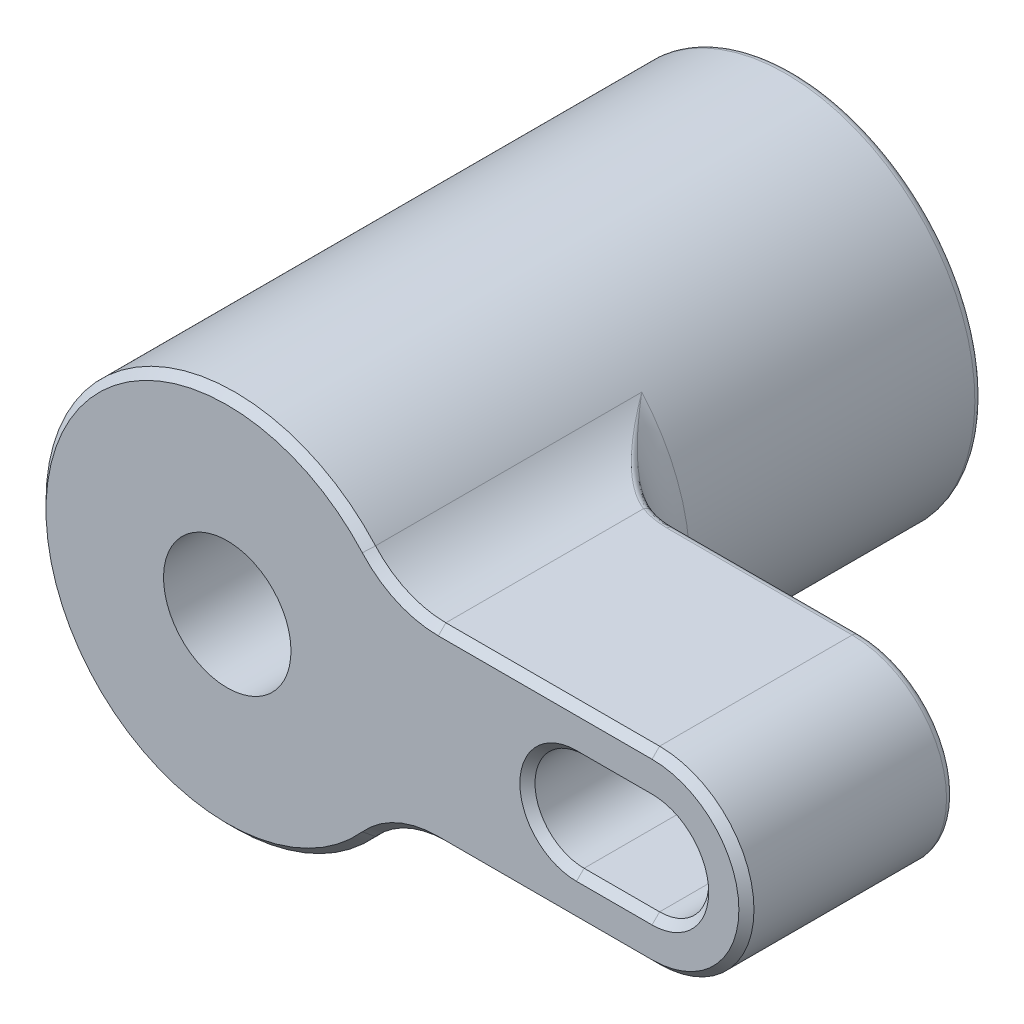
ISO-10303-21;
HEADER;
FILE_DESCRIPTION(('STEP AP214'),'2;1');
FILE_NAME('part.step','',(''),(''),'','','');
FILE_SCHEMA(('AUTOMOTIVE_DESIGN { 1 0 10303 214 1 1 1 1 }'));
ENDSEC;
DATA;
#1=APPLICATION_CONTEXT('core data for automotive mechanical design processes');
#2=APPLICATION_PROTOCOL_DEFINITION('international standard','automotive_design',2000,#1);
#3=PRODUCT_CONTEXT('',#1,'mechanical');
#4=PRODUCT('Part','Part','',(#3));
#5=PRODUCT_RELATED_PRODUCT_CATEGORY('part','',(#4));
#6=PRODUCT_DEFINITION_FORMATION('','',#4);
#7=PRODUCT_DEFINITION_CONTEXT('part definition',#1,'design');
#8=PRODUCT_DEFINITION('design','',#6,#7);
#9=PRODUCT_DEFINITION_SHAPE('','',#8);
#10=(LENGTH_UNIT() NAMED_UNIT(*) SI_UNIT(.MILLI.,.METRE.));
#11=(NAMED_UNIT(*) PLANE_ANGLE_UNIT() SI_UNIT($,.RADIAN.));
#12=(NAMED_UNIT(*) SI_UNIT($,.STERADIAN.) SOLID_ANGLE_UNIT());
#13=UNCERTAINTY_MEASURE_WITH_UNIT(LENGTH_MEASURE(1.E-05),#10,'distance_accuracy_value','');
#14=(GEOMETRIC_REPRESENTATION_CONTEXT(3) GLOBAL_UNCERTAINTY_ASSIGNED_CONTEXT((#13)) GLOBAL_UNIT_ASSIGNED_CONTEXT((#10,
#11,#12)) REPRESENTATION_CONTEXT('',''));
#15=CARTESIAN_POINT('',(0.,0.,0.));
#16=DIRECTION('',(0.,0.,1.));
#17=DIRECTION('',(1.,0.,0.));
#18=AXIS2_PLACEMENT_3D('',#15,#16,#17);
#19=CARTESIAN_POINT('',(0.,0.,38.));
#20=DIRECTION('',(0.,0.,1.));
#21=DIRECTION('',(0.,-1.,0.));
#22=AXIS2_PLACEMENT_3D('',#19,#20,#21);
#23=CYLINDRICAL_SURFACE('',#22,6.75);
#24=CARTESIAN_POINT('',(0.,0.,60.));
#25=DIRECTION('',(0.,0.,-1.));
#26=DIRECTION('',(0.,-1.,0.));
#27=AXIS2_PLACEMENT_3D('',#24,#25,#26);
#28=CIRCLE('',#27,6.75);
#29=CARTESIAN_POINT('',(0.,-6.75,60.));
#30=VERTEX_POINT('',#29);
#31=EDGE_CURVE('E248',#30,#30,#28,.T.);
#32=ORIENTED_EDGE('',*,*,#31,.F.);
#33=EDGE_LOOP('',(#32));
#34=FACE_BOUND('',#33,.T.);
#35=CARTESIAN_POINT('',(0.,0.,36.));
#36=DIRECTION('',(0.,0.,-1.));
#37=DIRECTION('',(-1.,0.,0.));
#38=AXIS2_PLACEMENT_3D('',#35,#36,#37);
#39=CIRCLE('',#38,6.75);
#40=CARTESIAN_POINT('',(-6.75,0.,36.));
#41=VERTEX_POINT('',#40);
#42=EDGE_CURVE('E18',#41,#41,#39,.T.);
#43=ORIENTED_EDGE('',*,*,#42,.T.);
#44=EDGE_LOOP('',(#43));
#45=FACE_BOUND('',#44,.T.);
#46=ADVANCED_FACE('F14',(#34,#45),#23,.F.);
#47=CARTESIAN_POINT('',(0.3,0.,60.));
#48=DIRECTION('',(0.,0.,-1.));
#49=DIRECTION('',(0.,1.,0.));
#50=AXIS2_PLACEMENT_3D('',#47,#48,#49);
#51=CYLINDRICAL_SURFACE('',#50,20.);
#52=DIRECTION('',(0.,0.,-1.));
#53=VECTOR('',#52,1.);
#54=CARTESIAN_POINT('',(-18.2404962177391,7.5,60.));
#55=LINE('',#54,#53);
#56=CARTESIAN_POINT('',(-18.2404962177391,7.5,51.5));
#57=VERTEX_POINT('',#56);
#58=CARTESIAN_POINT('',(-18.2404962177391,7.5,46.5));
#59=VERTEX_POINT('',#58);
#60=EDGE_CURVE('E976',#57,#59,#55,.T.);
#61=ORIENTED_EDGE('',*,*,#60,.T.);
#62=CARTESIAN_POINT('',(-18.6142803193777,6.5,45.5));
#63=CARTESIAN_POINT('',(-18.5817392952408,6.59469077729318,45.5));
#64=CARTESIAN_POINT('',(-18.5481741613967,6.68996637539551,45.5136598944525));
#65=CARTESIAN_POINT('',(-18.5154444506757,6.7807853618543,45.5402294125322));
#66=CARTESIAN_POINT('',(-18.4771957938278,6.88691841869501,45.5712791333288));
#67=CARTESIAN_POINT('',(-18.4392034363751,6.98940148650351,45.62080179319));
#68=CARTESIAN_POINT('',(-18.404736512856,7.08045422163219,45.6857071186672));
#69=CARTESIAN_POINT('',(-18.3724701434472,7.1656936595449,45.7464685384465));
#70=CARTESIAN_POINT('',(-18.342538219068,7.24295311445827,45.8222054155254));
#71=CARTESIAN_POINT('',(-18.3177591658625,7.30609633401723,45.9082156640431));
#72=CARTESIAN_POINT('',(-18.293779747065,7.36720188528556,45.9914503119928));
#73=CARTESIAN_POINT('',(-18.2740802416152,7.41652258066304,46.0864206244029));
#74=CARTESIAN_POINT('',(-18.2608376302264,7.4495171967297,46.1862850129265));
#75=CARTESIAN_POINT('',(-18.2475788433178,7.48255211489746,46.2862713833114));
#76=CARTESIAN_POINT('',(-18.2404962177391,7.5,46.3938662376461));
#77=CARTESIAN_POINT('',(-18.2404962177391,7.5,46.5));
#78=B_SPLINE_CURVE_WITH_KNOTS('',3,(#62,#63,#64,#65,#66,#67,#68,#69,#70,#71,#72,#73,#74,#75,#76,
#77),.UNSPECIFIED.,.F.,.F.,(4,3,3,3,3,4),(0.,0.185310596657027,0.40265316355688,
0.605958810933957,0.802765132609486,1.),.UNSPECIFIED.);
#79=CARTESIAN_POINT('',(-18.6142803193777,6.5,45.5));
#80=VERTEX_POINT('',#79);
#81=EDGE_CURVE('E959',#59,#80,#78,.F.);
#82=ORIENTED_EDGE('',*,*,#81,.T.);
#83=CARTESIAN_POINT('',(0.3,0.,45.5));
#84=DIRECTION('',(0.,0.,1.));
#85=DIRECTION('',(0.,1.,0.));
#86=AXIS2_PLACEMENT_3D('',#83,#84,#85);
#87=CIRCLE('',#86,20.);
#88=CARTESIAN_POINT('',(-18.6142803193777,-6.5,45.5));
#89=VERTEX_POINT('',#88);
#90=EDGE_CURVE('E607',#80,#89,#87,.T.);
#91=ORIENTED_EDGE('',*,*,#90,.T.);
#92=CARTESIAN_POINT('',(-18.2404962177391,-7.5,46.5));
#93=CARTESIAN_POINT('',(-18.2404962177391,-7.5,46.4484719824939));
#94=CARTESIAN_POINT('',(-18.2421214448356,-7.49598594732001,46.39676775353));
#95=CARTESIAN_POINT('',(-18.2453202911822,-7.48806352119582,46.3459530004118));
#96=CARTESIAN_POINT('',(-18.2524401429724,-7.4704301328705,46.2328517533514));
#97=CARTESIAN_POINT('',(-18.2677437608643,-7.43251239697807,46.1216901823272));
#98=CARTESIAN_POINT('',(-18.2890939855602,-7.3787251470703,46.0226718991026));
#99=CARTESIAN_POINT('',(-18.3118719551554,-7.32134100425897,45.9170320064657));
#100=CARTESIAN_POINT('',(-18.3421920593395,-7.24415027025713,45.8217263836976));
#101=CARTESIAN_POINT('',(-18.3762044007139,-7.15537484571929,45.7446962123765));
#102=CARTESIAN_POINT('',(-18.4109485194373,-7.06468941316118,45.666008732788));
#103=CARTESIAN_POINT('',(-18.450562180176,-6.959191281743,45.6038229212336));
#104=CARTESIAN_POINT('',(-18.4909692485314,-6.84831911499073,45.5626239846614));
#105=CARTESIAN_POINT('',(-18.5313546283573,-6.73750645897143,45.5214471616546));
#106=CARTESIAN_POINT('',(-18.5736800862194,-6.6181421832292,45.5));
#107=CARTESIAN_POINT('',(-18.6142803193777,-6.5,45.5));
#108=B_SPLINE_CURVE_WITH_KNOTS('',3,(#92,#93,#94,#95,#96,#97,#98,#99,#100,#101,#102,#103,#104,
#105,#106,#107),.UNSPECIFIED.,.F.,.F.,(4,3,3,3,3,4),(0.,0.094546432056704,0.307808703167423,
0.535468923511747,0.767857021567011,1.),.UNSPECIFIED.);
#109=CARTESIAN_POINT('',(-18.2404962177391,-7.5,46.5));
#110=VERTEX_POINT('',#109);
#111=EDGE_CURVE('E932',#89,#110,#108,.F.);
#112=ORIENTED_EDGE('',*,*,#111,.T.);
#113=DIRECTION('',(0.,0.,-1.));
#114=VECTOR('',#113,1.);
#115=CARTESIAN_POINT('',(-18.2404962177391,-7.5,60.));
#116=LINE('',#115,#114);
#117=CARTESIAN_POINT('',(-18.2404962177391,-7.5,51.5));
#118=VERTEX_POINT('',#117);
#119=EDGE_CURVE('E918',#118,#110,#116,.T.);
#120=ORIENTED_EDGE('',*,*,#119,.F.);
#121=CARTESIAN_POINT('',(-18.6142803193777,-6.5,52.5));
#122=CARTESIAN_POINT('',(-18.5817392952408,-6.5946907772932,52.5));
#123=CARTESIAN_POINT('',(-18.5481741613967,-6.68996637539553,52.4863401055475));
#124=CARTESIAN_POINT('',(-18.5154444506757,-6.78078536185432,52.4597705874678));
#125=CARTESIAN_POINT('',(-18.4771957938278,-6.88691841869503,52.4287208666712));
#126=CARTESIAN_POINT('',(-18.4392034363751,-6.98940148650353,52.37919820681));
#127=CARTESIAN_POINT('',(-18.404736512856,-7.08045422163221,52.3142928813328));
#128=CARTESIAN_POINT('',(-18.3724701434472,-7.16569365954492,52.2535314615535));
#129=CARTESIAN_POINT('',(-18.342538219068,-7.24295311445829,52.1777945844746));
#130=CARTESIAN_POINT('',(-18.3177591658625,-7.30609633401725,52.0917843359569));
#131=CARTESIAN_POINT('',(-18.293779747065,-7.36720188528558,52.0085496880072));
#132=CARTESIAN_POINT('',(-18.2740802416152,-7.41652258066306,51.9135793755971));
#133=CARTESIAN_POINT('',(-18.2608376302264,-7.44951719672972,51.8137149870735));
#134=CARTESIAN_POINT('',(-18.2475788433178,-7.48255211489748,51.7137286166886));
#135=CARTESIAN_POINT('',(-18.2404962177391,-7.5,51.6061337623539));
#136=CARTESIAN_POINT('',(-18.2404962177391,-7.5,51.5));
#137=B_SPLINE_CURVE_WITH_KNOTS('',3,(#121,#122,#123,#124,#125,#126,#127,#128,#129,#130,#131,
#132,#133,#134,#135,#136),.UNSPECIFIED.,.F.,.F.,(4,3,3,3,3,4),(0.,0.185310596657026,
0.40265316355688,0.605958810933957,0.802765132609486,1.),.UNSPECIFIED.);
#138=CARTESIAN_POINT('',(-18.6142803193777,-6.5,52.5));
#139=VERTEX_POINT('',#138);
#140=EDGE_CURVE('E685',#118,#139,#137,.F.);
#141=ORIENTED_EDGE('',*,*,#140,.T.);
#142=CARTESIAN_POINT('',(0.3,0.,52.5));
#143=DIRECTION('',(0.,0.,-1.));
#144=DIRECTION('',(0.,-1.,0.));
#145=AXIS2_PLACEMENT_3D('',#142,#143,#144);
#146=CIRCLE('',#145,20.);
#147=CARTESIAN_POINT('',(-18.6142803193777,6.5,52.5));
#148=VERTEX_POINT('',#147);
#149=EDGE_CURVE('E669',#139,#148,#146,.T.);
#150=ORIENTED_EDGE('',*,*,#149,.T.);
#151=CARTESIAN_POINT('',(-18.2404962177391,7.5,51.5));
#152=CARTESIAN_POINT('',(-18.2404962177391,7.5,51.5515280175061));
#153=CARTESIAN_POINT('',(-18.2421214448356,7.49598594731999,51.60323224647));
#154=CARTESIAN_POINT('',(-18.2453202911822,7.4880635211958,51.6540469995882));
#155=CARTESIAN_POINT('',(-18.2524401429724,7.47043013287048,51.7671482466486));
#156=CARTESIAN_POINT('',(-18.2677437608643,7.43251239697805,51.8783098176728));
#157=CARTESIAN_POINT('',(-18.2890939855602,7.37872514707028,51.9773281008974));
#158=CARTESIAN_POINT('',(-18.3118719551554,7.32134100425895,52.0829679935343));
#159=CARTESIAN_POINT('',(-18.3421920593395,7.24415027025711,52.1782736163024));
#160=CARTESIAN_POINT('',(-18.3762044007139,7.15537484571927,52.2553037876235));
#161=CARTESIAN_POINT('',(-18.4109485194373,7.06468941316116,52.333991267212));
#162=CARTESIAN_POINT('',(-18.450562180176,6.95919128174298,52.3961770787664));
#163=CARTESIAN_POINT('',(-18.4909692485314,6.84831911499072,52.4373760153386));
#164=CARTESIAN_POINT('',(-18.5313546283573,6.73750645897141,52.4785528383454));
#165=CARTESIAN_POINT('',(-18.5736800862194,6.61814218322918,52.5));
#166=CARTESIAN_POINT('',(-18.6142803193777,6.5,52.5));
#167=B_SPLINE_CURVE_WITH_KNOTS('',3,(#151,#152,#153,#154,#155,#156,#157,#158,#159,#160,#161,
#162,#163,#164,#165,#166),.UNSPECIFIED.,.F.,.F.,(4,3,3,3,3,4),(0.,0.094546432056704,
0.307808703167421,0.535468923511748,0.767857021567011,1.),.UNSPECIFIED.);
#168=EDGE_CURVE('E1004',#148,#57,#167,.F.);
#169=ORIENTED_EDGE('',*,*,#168,.T.);
#170=EDGE_LOOP('',(#61,#82,#91,#112,#120,#141,#150,#169));
#171=FACE_BOUND('',#170,.T.);
#172=CARTESIAN_POINT('',(-19.6436706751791,1.49999999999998,51.75));
#173=CARTESIAN_POINT('',(-19.5521907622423,2.71552596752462,51.0482157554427));
#174=CARTESIAN_POINT('',(-19.3139735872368,3.9105038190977,50.3582949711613));
#175=CARTESIAN_POINT('',(-19.0758491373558,5.10501653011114,49.6686427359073));
#176=CARTESIAN_POINT('',(-18.6940275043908,6.2631397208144,49.));
#177=B_SPLINE_CURVE_WITH_KNOTS('',2,(#172,#173,#174,#175,#176),.UNSPECIFIED.,.F.,.F.,(3,2,3),
(0.,0.5,1.),.UNSPECIFIED.);
#178=CARTESIAN_POINT('',(-19.6436706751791,1.5,51.75));
#179=VERTEX_POINT('',#178);
#180=CARTESIAN_POINT('',(-18.6940275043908,6.26313972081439,49.));
#181=VERTEX_POINT('',#180);
#182=EDGE_CURVE('E741',#179,#181,#177,.T.);
#183=ORIENTED_EDGE('',*,*,#182,.F.);
#184=DIRECTION('',(0.,0.,-1.));
#185=VECTOR('',#184,1.);
#186=CARTESIAN_POINT('',(-19.6436706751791,1.5,60.));
#187=LINE('',#186,#185);
#188=CARTESIAN_POINT('',(-19.6436706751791,1.5,50.75));
#189=VERTEX_POINT('',#188);
#190=EDGE_CURVE('E752',#179,#189,#187,.T.);
#191=ORIENTED_EDGE('',*,*,#190,.T.);
#192=CARTESIAN_POINT('',(0.3,0.,50.75));
#193=DIRECTION('',(0.,0.,-1.));
#194=DIRECTION('',(0.,-1.,0.));
#195=AXIS2_PLACEMENT_3D('',#192,#193,#194);
#196=CIRCLE('',#195,20.);
#197=CARTESIAN_POINT('',(-18.7787840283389,-6.,50.75));
#198=VERTEX_POINT('',#197);
#199=EDGE_CURVE('E819',#198,#189,#196,.T.);
#200=ORIENTED_EDGE('',*,*,#199,.F.);
#201=DIRECTION('',(0.,0.,-1.));
#202=VECTOR('',#201,1.);
#203=CARTESIAN_POINT('',(-18.7787840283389,-6.,60.));
#204=LINE('',#203,#202);
#205=CARTESIAN_POINT('',(-18.7787840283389,-6.,47.25));
#206=VERTEX_POINT('',#205);
#207=EDGE_CURVE('E828',#198,#206,#204,.T.);
#208=ORIENTED_EDGE('',*,*,#207,.T.);
#209=CARTESIAN_POINT('',(0.3,0.,47.25));
#210=DIRECTION('',(0.,0.,1.));
#211=DIRECTION('',(0.,1.,0.));
#212=AXIS2_PLACEMENT_3D('',#209,#210,#211);
#213=CIRCLE('',#212,20.);
#214=CARTESIAN_POINT('',(-19.6436706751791,1.5,47.25));
#215=VERTEX_POINT('',#214);
#216=EDGE_CURVE('E846',#215,#206,#213,.T.);
#217=ORIENTED_EDGE('',*,*,#216,.F.);
#218=DIRECTION('',(0.,0.,-1.));
#219=VECTOR('',#218,1.);
#220=CARTESIAN_POINT('',(-19.6436706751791,1.5,60.));
#221=LINE('',#220,#219);
#222=CARTESIAN_POINT('',(-19.6436706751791,1.5,46.25));
#223=VERTEX_POINT('',#222);
#224=EDGE_CURVE('E872',#215,#223,#221,.T.);
#225=ORIENTED_EDGE('',*,*,#224,.T.);
#226=CARTESIAN_POINT('',(-18.6940275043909,6.26313972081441,49.));
#227=CARTESIAN_POINT('',(-19.0756995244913,5.10547032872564,48.331619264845));
#228=CARTESIAN_POINT('',(-19.3139735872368,3.91050381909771,47.6417050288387));
#229=CARTESIAN_POINT('',(-19.5521549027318,2.71600244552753,46.9520593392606));
#230=CARTESIAN_POINT('',(-19.6436706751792,1.5,46.25));
#231=B_SPLINE_CURVE_WITH_KNOTS('',2,(#226,#227,#228,#229,#230),.UNSPECIFIED.,.F.,.F.,(3,2,3),
(0.,0.5,1.),.UNSPECIFIED.);
#232=EDGE_CURVE('E756',#181,#223,#231,.T.);
#233=ORIENTED_EDGE('',*,*,#232,.F.);
#234=EDGE_LOOP('',(#183,#191,#200,#208,#217,#225,#233));
#235=FACE_BOUND('',#234,.T.);
#236=ADVANCED_FACE('F693',(#171,#235),#51,.T.);
#237=CARTESIAN_POINT('',(0.,0.,60.));
#238=DIRECTION('',(0.,0.,1.));
#239=DIRECTION('',(0.,-1.,0.));
#240=AXIS2_PLACEMENT_3D('',#237,#238,#239);
#241=PLANE('',#240);
#242=CARTESIAN_POINT('',(37.,0.,60.));
#243=DIRECTION('',(0.,0.,-1.));
#244=DIRECTION('',(0.,-1.,0.));
#245=AXIS2_PLACEMENT_3D('',#242,#243,#244);
#246=CIRCLE('',#245,6.);
#247=CARTESIAN_POINT('',(37.,6.,60.));
#248=VERTEX_POINT('',#247);
#249=CARTESIAN_POINT('',(37.,-6.,60.));
#250=VERTEX_POINT('',#249);
#251=EDGE_CURVE('E564',#248,#250,#246,.F.);
#252=ORIENTED_EDGE('',*,*,#251,.F.);
#253=DIRECTION('',(-1.,0.,0.));
#254=VECTOR('',#253,1.);
#255=CARTESIAN_POINT('',(37.,6.,60.));
#256=LINE('',#255,#254);
#257=CARTESIAN_POINT('',(45.,6.,60.));
#258=VERTEX_POINT('',#257);
#259=EDGE_CURVE('E209',#258,#248,#256,.T.);
#260=ORIENTED_EDGE('',*,*,#259,.F.);
#261=CARTESIAN_POINT('',(45.,0.,60.));
#262=DIRECTION('',(0.,0.,-1.));
#263=DIRECTION('',(0.,-1.,0.));
#264=AXIS2_PLACEMENT_3D('',#261,#262,#263);
#265=CIRCLE('',#264,6.);
#266=CARTESIAN_POINT('',(45.,-6.,60.));
#267=VERTEX_POINT('',#266);
#268=EDGE_CURVE('E561',#267,#258,#265,.F.);
#269=ORIENTED_EDGE('',*,*,#268,.F.);
#270=DIRECTION('',(1.,0.,0.));
#271=VECTOR('',#270,1.);
#272=CARTESIAN_POINT('',(45.,-6.,60.));
#273=LINE('',#272,#271);
#274=EDGE_CURVE('E235',#250,#267,#273,.T.);
#275=ORIENTED_EDGE('',*,*,#274,.F.);
#276=EDGE_LOOP('',(#252,#260,#269,#275));
#277=FACE_BOUND('',#276,.T.);
#278=CARTESIAN_POINT('',(22.3606797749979,-20.,60.));
#279=DIRECTION('',(0.,0.,-1.));
#280=DIRECTION('',(0.,-1.,0.));
#281=AXIS2_PLACEMENT_3D('',#278,#279,#280);
#282=CIRCLE('',#281,10.8);
#283=CARTESIAN_POINT('',(22.3606797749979,-9.2,60.));
#284=VERTEX_POINT('',#283);
#285=CARTESIAN_POINT('',(14.3108350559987,-12.8,60.));
#286=VERTEX_POINT('',#285);
#287=EDGE_CURVE('E518',#284,#286,#282,.F.);
#288=ORIENTED_EDGE('',*,*,#287,.F.);
#289=DIRECTION('',(-1.,0.,0.));
#290=VECTOR('',#289,1.);
#291=CARTESIAN_POINT('',(22.3606797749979,-9.2,60.));
#292=LINE('',#291,#290);
#293=CARTESIAN_POINT('',(45.,-9.2,60.));
#294=VERTEX_POINT('',#293);
#295=EDGE_CURVE('E515',#294,#284,#292,.T.);
#296=ORIENTED_EDGE('',*,*,#295,.F.);
#297=CARTESIAN_POINT('',(45.,0.,60.));
#298=DIRECTION('',(0.,0.,-1.));
#299=DIRECTION('',(0.,-1.,0.));
#300=AXIS2_PLACEMENT_3D('',#297,#298,#299);
#301=CIRCLE('',#300,9.2);
#302=CARTESIAN_POINT('',(45.,9.2,60.));
#303=VERTEX_POINT('',#302);
#304=EDGE_CURVE('E522',#303,#294,#301,.T.);
#305=ORIENTED_EDGE('',*,*,#304,.F.);
#306=DIRECTION('',(1.,0.,0.));
#307=VECTOR('',#306,1.);
#308=CARTESIAN_POINT('',(45.,9.2,60.));
#309=LINE('',#308,#307);
#310=CARTESIAN_POINT('',(22.3606797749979,9.2,60.));
#311=VERTEX_POINT('',#310);
#312=EDGE_CURVE('E525',#311,#303,#309,.T.);
#313=ORIENTED_EDGE('',*,*,#312,.F.);
#314=CARTESIAN_POINT('',(22.3606797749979,20.,60.));
#315=DIRECTION('',(0.,0.,-1.));
#316=DIRECTION('',(0.,-1.,0.));
#317=AXIS2_PLACEMENT_3D('',#314,#315,#316);
#318=CIRCLE('',#317,10.8);
#319=CARTESIAN_POINT('',(14.3108350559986,12.8,60.));
#320=VERTEX_POINT('',#319);
#321=EDGE_CURVE('E528',#320,#311,#318,.F.);
#322=ORIENTED_EDGE('',*,*,#321,.F.);
#323=CARTESIAN_POINT('',(0.,0.,60.));
#324=DIRECTION('',(0.,0.,-1.));
#325=DIRECTION('',(0.,-1.,0.));
#326=AXIS2_PLACEMENT_3D('',#323,#324,#325);
#327=CIRCLE('',#326,19.2);
#328=EDGE_CURVE('E531',#286,#320,#327,.T.);
#329=ORIENTED_EDGE('',*,*,#328,.F.);
#330=EDGE_LOOP('',(#288,#296,#305,#313,#322,#329));
#331=FACE_BOUND('',#330,.T.);
#332=ORIENTED_EDGE('',*,*,#31,.T.);
#333=EDGE_LOOP('',(#332));
#334=FACE_BOUND('',#333,.T.);
#335=ADVANCED_FACE('F703',(#277,#331,#334),#241,.T.);
#336=CARTESIAN_POINT('',(0.,0.,0.));
#337=DIRECTION('',(0.,0.,1.));
#338=DIRECTION('',(0.,-1.,0.));
#339=AXIS2_PLACEMENT_3D('',#336,#337,#338);
#340=PLANE('',#339);
#341=CARTESIAN_POINT('',(0.,0.,0.));
#342=DIRECTION('',(0.,0.,-1.));
#343=DIRECTION('',(-1.,0.,0.));
#344=AXIS2_PLACEMENT_3D('',#341,#342,#343);
#345=CIRCLE('',#344,14.);
#346=CARTESIAN_POINT('',(-14.,0.,0.));
#347=VERTEX_POINT('',#346);
#348=EDGE_CURVE('E1044',#347,#347,#345,.T.);
#349=ORIENTED_EDGE('',*,*,#348,.F.);
#350=EDGE_LOOP('',(#349));
#351=FACE_BOUND('',#350,.T.);
#352=CARTESIAN_POINT('',(0.,0.,0.));
#353=DIRECTION('',(0.,0.,-1.));
#354=DIRECTION('',(0.,-1.,0.));
#355=AXIS2_PLACEMENT_3D('',#352,#353,#354);
#356=CIRCLE('',#355,19.2);
#357=CARTESIAN_POINT('',(0.,-19.2,0.));
#358=VERTEX_POINT('',#357);
#359=EDGE_CURVE('E273',#358,#358,#356,.F.);
#360=ORIENTED_EDGE('',*,*,#359,.F.);
#361=EDGE_LOOP('',(#360));
#362=FACE_BOUND('',#361,.T.);
#363=ADVANCED_FACE('F592',(#351,#362),#340,.F.);
#364=CARTESIAN_POINT('',(0.,0.,60.));
#365=DIRECTION('',(0.,0.,-1.));
#366=DIRECTION('',(0.,1.,0.));
#367=AXIS2_PLACEMENT_3D('',#364,#365,#366);
#368=CYLINDRICAL_SURFACE('',#367,20.);
#369=CARTESIAN_POINT('',(-18.5404962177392,7.5,46.5));
#370=CARTESIAN_POINT('',(-18.5404962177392,7.5,46.3938662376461));
#371=CARTESIAN_POINT('',(-18.5475788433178,7.48255211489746,46.2862713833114));
#372=CARTESIAN_POINT('',(-18.5608376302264,7.4495171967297,46.1862850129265));
#373=CARTESIAN_POINT('',(-18.5740802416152,7.41652258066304,46.0864206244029));
#374=CARTESIAN_POINT('',(-18.593779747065,7.36720188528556,45.9914503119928));
#375=CARTESIAN_POINT('',(-18.6177591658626,7.30609633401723,45.9082156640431));
#376=CARTESIAN_POINT('',(-18.642538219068,7.24295311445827,45.8222054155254));
#377=CARTESIAN_POINT('',(-18.6724701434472,7.1656936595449,45.7464685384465));
#378=CARTESIAN_POINT('',(-18.704736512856,7.08045422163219,45.6857071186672));
#379=CARTESIAN_POINT('',(-18.7392034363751,6.98940148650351,45.62080179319));
#380=CARTESIAN_POINT('',(-18.7771957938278,6.88691841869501,45.5712791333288));
#381=CARTESIAN_POINT('',(-18.8154444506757,6.7807853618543,45.5402294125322));
#382=CARTESIAN_POINT('',(-18.8481741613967,6.68996637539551,45.5136598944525));
#383=CARTESIAN_POINT('',(-18.8817392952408,6.59469077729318,45.5));
#384=CARTESIAN_POINT('',(-18.9142803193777,6.5,45.5));
#385=B_SPLINE_CURVE_WITH_KNOTS('',3,(#369,#370,#371,#372,#373,#374,#375,#376,#377,#378,#379,
#380,#381,#382,#383,#384),.UNSPECIFIED.,.F.,.F.,(4,3,3,3,3,4),(0.,0.197234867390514,
0.394041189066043,0.59734683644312,0.814689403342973,1.),.UNSPECIFIED.);
#386=CARTESIAN_POINT('',(-18.5404962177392,7.5,46.5));
#387=VERTEX_POINT('',#386);
#388=CARTESIAN_POINT('',(-18.9142803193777,6.5,45.5));
#389=VERTEX_POINT('',#388);
#390=EDGE_CURVE('E996',#387,#389,#385,.T.);
#391=ORIENTED_EDGE('',*,*,#390,.F.);
#392=DIRECTION('',(0.,0.,-1.));
#393=VECTOR('',#392,1.);
#394=CARTESIAN_POINT('',(-18.5404962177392,7.5,60.));
#395=LINE('',#394,#393);
#396=CARTESIAN_POINT('',(-18.5404962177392,7.5,51.5));
#397=VERTEX_POINT('',#396);
#398=EDGE_CURVE('E571',#397,#387,#395,.T.);
#399=ORIENTED_EDGE('',*,*,#398,.F.);
#400=CARTESIAN_POINT('',(-18.9142803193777,6.5,52.5));
#401=CARTESIAN_POINT('',(-18.9040976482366,6.52963255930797,52.4999930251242));
#402=CARTESIAN_POINT('',(-18.8938458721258,6.55923546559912,52.4986505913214));
#403=CARTESIAN_POINT('',(-18.873274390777,6.61819323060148,52.493354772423));
#404=CARTESIAN_POINT('',(-18.8629546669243,6.64754801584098,52.4894006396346));
#405=CARTESIAN_POINT('',(-18.8423180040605,6.70581908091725,52.4789386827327));
#406=CARTESIAN_POINT('',(-18.832001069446,6.73473511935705,52.4724295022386));
#407=CARTESIAN_POINT('',(-18.8114598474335,6.79189972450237,52.4568759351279));
#408=CARTESIAN_POINT('',(-18.8012355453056,6.82014839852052,52.4478319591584));
#409=CARTESIAN_POINT('',(-18.770823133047,6.90360006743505,52.4168579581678));
#410=CARTESIAN_POINT('',(-18.7508921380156,6.9575182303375,52.391084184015));
#411=CARTESIAN_POINT('',(-18.7124128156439,7.06035542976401,52.3302802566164));
#412=CARTESIAN_POINT('',(-18.6938639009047,7.1092765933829,52.2952540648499));
#413=CARTESIAN_POINT('',(-18.6593225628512,7.19944317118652,52.2171131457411));
#414=CARTESIAN_POINT('',(-18.6432876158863,7.24081879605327,52.1741680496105));
#415=CARTESIAN_POINT('',(-18.6139739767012,7.31584492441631,52.0811370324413));
#416=CARTESIAN_POINT('',(-18.6006950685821,7.34949603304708,52.0310516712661));
#417=CARTESIAN_POINT('',(-18.5784807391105,7.4054654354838,51.9281798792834));
#418=CARTESIAN_POINT('',(-18.5693277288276,7.42835524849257,51.8757512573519));
#419=CARTESIAN_POINT('',(-18.554572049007,7.46513545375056,51.7674043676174));
#420=CARTESIAN_POINT('',(-18.5489633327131,7.47904117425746,51.7114922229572));
#421=CARTESIAN_POINT('',(-18.5437416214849,7.49197324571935,51.6291587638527));
#422=CARTESIAN_POINT('',(-18.5425275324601,7.4949769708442,51.6034152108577));
#423=CARTESIAN_POINT('',(-18.540908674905,7.49898044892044,51.5517837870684));
#424=CARTESIAN_POINT('',(-18.5405027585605,7.49998304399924,51.5258961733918));
#425=CARTESIAN_POINT('',(-18.5404962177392,7.5,51.5));
#426=B_SPLINE_CURVE_WITH_KNOTS('',3,(#400,#401,#402,#403,#404,#405,#406,#407,#408,#409,#410,
#411,#412,#413,#414,#415,#416,#417,#418,#419,#420,#421,#422,#423,#424,#425),.UNSPECIFIED.,.F.,
.F.,(4,2,2,2,2,2,2,2,2,2,2,2,4),(0.,0.0939632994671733,0.187953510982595,0.281993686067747,
0.376018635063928,0.564038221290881,0.751977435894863,0.93627995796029,1.12056803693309,
1.2934755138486,1.46608719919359,1.54384721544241,1.62149671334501),.UNSPECIFIED.);
#427=CARTESIAN_POINT('',(-18.9142803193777,6.5,52.5));
#428=VERTEX_POINT('',#427);
#429=EDGE_CURVE('E609',#428,#397,#426,.T.);
#430=ORIENTED_EDGE('',*,*,#429,.F.);
#431=CARTESIAN_POINT('',(0.,0.,52.5));
#432=DIRECTION('',(0.,0.,-1.));
#433=DIRECTION('',(0.,-1.,0.));
#434=AXIS2_PLACEMENT_3D('',#431,#432,#433);
#435=CIRCLE('',#434,20.);
#436=CARTESIAN_POINT('',(-18.9142803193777,-6.5,52.5));
#437=VERTEX_POINT('',#436);
#438=EDGE_CURVE('E916',#437,#428,#435,.T.);
#439=ORIENTED_EDGE('',*,*,#438,.F.);
#440=CARTESIAN_POINT('',(-18.5404962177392,-7.5,51.5));
#441=CARTESIAN_POINT('',(-18.5404962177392,-7.5,51.6061337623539));
#442=CARTESIAN_POINT('',(-18.5475788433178,-7.48255211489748,51.7137286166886));
#443=CARTESIAN_POINT('',(-18.5608376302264,-7.44951719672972,51.8137149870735));
#444=CARTESIAN_POINT('',(-18.5740802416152,-7.41652258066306,51.9135793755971));
#445=CARTESIAN_POINT('',(-18.593779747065,-7.36720188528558,52.0085496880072));
#446=CARTESIAN_POINT('',(-18.6177591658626,-7.30609633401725,52.0917843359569));
#447=CARTESIAN_POINT('',(-18.642538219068,-7.24295311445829,52.1777945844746));
#448=CARTESIAN_POINT('',(-18.6724701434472,-7.16569365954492,52.2535314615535));
#449=CARTESIAN_POINT('',(-18.704736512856,-7.08045422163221,52.3142928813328));
#450=CARTESIAN_POINT('',(-18.7392034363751,-6.98940148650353,52.37919820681));
#451=CARTESIAN_POINT('',(-18.7771957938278,-6.88691841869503,52.4287208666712));
#452=CARTESIAN_POINT('',(-18.8154444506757,-6.78078536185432,52.4597705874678));
#453=CARTESIAN_POINT('',(-18.8481741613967,-6.68996637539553,52.4863401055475));
#454=CARTESIAN_POINT('',(-18.8817392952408,-6.5946907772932,52.5));
#455=CARTESIAN_POINT('',(-18.9142803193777,-6.5,52.5));
#456=B_SPLINE_CURVE_WITH_KNOTS('',3,(#440,#441,#442,#443,#444,#445,#446,#447,#448,#449,#450,
#451,#452,#453,#454,#455),.UNSPECIFIED.,.F.,.F.,(4,3,3,3,3,4),(0.,0.197234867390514,
0.394041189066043,0.59734683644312,0.814689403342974,1.),.UNSPECIFIED.);
#457=CARTESIAN_POINT('',(-18.5404962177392,-7.5,51.5));
#458=VERTEX_POINT('',#457);
#459=EDGE_CURVE('E579',#458,#437,#456,.T.);
#460=ORIENTED_EDGE('',*,*,#459,.F.);
#461=DIRECTION('',(0.,0.,-1.));
#462=VECTOR('',#461,1.);
#463=CARTESIAN_POINT('',(-18.5404962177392,-7.5,60.));
#464=LINE('',#463,#462);
#465=CARTESIAN_POINT('',(-18.5404962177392,-7.5,46.5));
#466=VERTEX_POINT('',#465);
#467=EDGE_CURVE('E935',#458,#466,#464,.T.);
#468=ORIENTED_EDGE('',*,*,#467,.T.);
#469=CARTESIAN_POINT('',(-18.9142803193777,-6.5,45.5));
#470=CARTESIAN_POINT('',(-18.9040976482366,-6.52963255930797,45.5000069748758));
#471=CARTESIAN_POINT('',(-18.8938458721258,-6.55923546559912,45.5013494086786));
#472=CARTESIAN_POINT('',(-18.873274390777,-6.61819323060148,45.506645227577));
#473=CARTESIAN_POINT('',(-18.8629546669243,-6.64754801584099,45.5105993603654));
#474=CARTESIAN_POINT('',(-18.8423180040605,-6.70581908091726,45.5210613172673));
#475=CARTESIAN_POINT('',(-18.832001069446,-6.73473511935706,45.5275704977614));
#476=CARTESIAN_POINT('',(-18.8114598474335,-6.79189972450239,45.5431240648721));
#477=CARTESIAN_POINT('',(-18.8012355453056,-6.82014839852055,45.5521680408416));
#478=CARTESIAN_POINT('',(-18.7708231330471,-6.90360006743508,45.5831420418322));
#479=CARTESIAN_POINT('',(-18.7508921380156,-6.95751823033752,45.608915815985));
#480=CARTESIAN_POINT('',(-18.7124128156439,-7.06035542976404,45.6697197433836));
#481=CARTESIAN_POINT('',(-18.6938639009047,-7.10927659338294,45.7047459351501));
#482=CARTESIAN_POINT('',(-18.6593225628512,-7.19944317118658,45.7828868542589));
#483=CARTESIAN_POINT('',(-18.6432876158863,-7.24081879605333,45.8258319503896));
#484=CARTESIAN_POINT('',(-18.6139739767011,-7.31584492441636,45.9188629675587));
#485=CARTESIAN_POINT('',(-18.600695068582,-7.34949603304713,45.968948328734));
#486=CARTESIAN_POINT('',(-18.5784807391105,-7.40546543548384,46.0718201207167));
#487=CARTESIAN_POINT('',(-18.5693277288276,-7.42835524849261,46.1242487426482));
#488=CARTESIAN_POINT('',(-18.554572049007,-7.4651354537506,46.2325956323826));
#489=CARTESIAN_POINT('',(-18.5489633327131,-7.4790411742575,46.2885077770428));
#490=CARTESIAN_POINT('',(-18.5437416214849,-7.49197324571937,46.3708412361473));
#491=CARTESIAN_POINT('',(-18.5425275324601,-7.49497697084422,46.3965847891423));
#492=CARTESIAN_POINT('',(-18.540908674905,-7.49898044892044,46.4482162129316));
#493=CARTESIAN_POINT('',(-18.5405027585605,-7.49998304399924,46.4741038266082));
#494=CARTESIAN_POINT('',(-18.5404962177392,-7.5,46.5));
#495=B_SPLINE_CURVE_WITH_KNOTS('',3,(#469,#470,#471,#472,#473,#474,#475,#476,#477,#478,#479,
#480,#481,#482,#483,#484,#485,#486,#487,#488,#489,#490,#491,#492,#493,#494),.UNSPECIFIED.,.F.,
.F.,(4,2,2,2,2,2,2,2,2,2,2,2,4),(0.,0.093963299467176,0.187953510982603,0.281993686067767,
0.376018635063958,0.56403822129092,0.751977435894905,0.936279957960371,1.12056803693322,
1.29347551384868,1.46608719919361,1.54384721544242,1.62149671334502),.UNSPECIFIED.);
#496=CARTESIAN_POINT('',(-18.9142803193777,-6.5,45.5));
#497=VERTEX_POINT('',#496);
#498=EDGE_CURVE('E600',#497,#466,#495,.T.);
#499=ORIENTED_EDGE('',*,*,#498,.F.);
#500=CARTESIAN_POINT('',(0.,0.,45.5));
#501=DIRECTION('',(0.,0.,1.));
#502=DIRECTION('',(0.,1.,0.));
#503=AXIS2_PLACEMENT_3D('',#500,#501,#502);
#504=CIRCLE('',#503,20.);
#505=EDGE_CURVE('E956',#389,#497,#504,.T.);
#506=ORIENTED_EDGE('',*,*,#505,.F.);
#507=EDGE_LOOP('',(#391,#399,#430,#439,#460,#468,#499,#506));
#508=FACE_BOUND('',#507,.T.);
#509=CARTESIAN_POINT('',(0.,0.,0.8));
#510=DIRECTION('',(0.,0.,-1.));
#511=DIRECTION('',(0.,-1.,0.));
#512=AXIS2_PLACEMENT_3D('',#509,#510,#511);
#513=CIRCLE('',#512,20.);
#514=CARTESIAN_POINT('',(0.,-20.,0.8));
#515=VERTEX_POINT('',#514);
#516=EDGE_CURVE('E270',#515,#515,#513,.T.);
#517=ORIENTED_EDGE('',*,*,#516,.F.);
#518=EDGE_LOOP('',(#517));
#519=FACE_BOUND('',#518,.T.);
#520=DIRECTION('',(0.,0.,-1.));
#521=VECTOR('',#520,1.);
#522=CARTESIAN_POINT('',(14.9071198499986,13.3333333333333,60.));
#523=LINE('',#522,#521);
#524=CARTESIAN_POINT('',(14.9071198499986,13.3333333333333,31.));
#525=VERTEX_POINT('',#524);
#526=CARTESIAN_POINT('',(14.9071198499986,13.3333333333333,59.2));
#527=VERTEX_POINT('',#526);
#528=EDGE_CURVE('E264',#525,#527,#523,.F.);
#529=ORIENTED_EDGE('',*,*,#528,.F.);
#530=CARTESIAN_POINT('',(0.,0.,31.));
#531=DIRECTION('',(0.,0.,-1.));
#532=DIRECTION('',(0.,-1.,0.));
#533=AXIS2_PLACEMENT_3D('',#530,#531,#532);
#534=CIRCLE('',#533,20.);
#535=CARTESIAN_POINT('',(14.9071198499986,-13.3333333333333,31.));
#536=VERTEX_POINT('',#535);
#537=EDGE_CURVE('E279',#536,#525,#534,.F.);
#538=ORIENTED_EDGE('',*,*,#537,.F.);
#539=DIRECTION('',(0.,0.,-1.));
#540=VECTOR('',#539,1.);
#541=CARTESIAN_POINT('',(14.9071198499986,-13.3333333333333,60.));
#542=LINE('',#541,#540);
#543=CARTESIAN_POINT('',(14.9071198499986,-13.3333333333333,59.2));
#544=VERTEX_POINT('',#543);
#545=EDGE_CURVE('E261',#544,#536,#542,.T.);
#546=ORIENTED_EDGE('',*,*,#545,.F.);
#547=CARTESIAN_POINT('',(0.,0.,59.2));
#548=DIRECTION('',(0.,0.,-1.));
#549=DIRECTION('',(0.,-1.,0.));
#550=AXIS2_PLACEMENT_3D('',#547,#548,#549);
#551=CIRCLE('',#550,20.);
#552=EDGE_CURVE('E495',#527,#544,#551,.F.);
#553=ORIENTED_EDGE('',*,*,#552,.F.);
#554=EDGE_LOOP('',(#529,#538,#546,#553));
#555=FACE_BOUND('',#554,.T.);
#556=ADVANCED_FACE('F494',(#508,#519,#555),#368,.T.);
#557=CARTESIAN_POINT('',(17.3205080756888,10.,60.));
#558=DIRECTION('',(0.,-1.,0.));
#559=DIRECTION('',(-1.,0.,0.));
#560=AXIS2_PLACEMENT_3D('',#557,#558,#559);
#561=PLANE('',#560);
#562=DIRECTION('',(0.,0.,-1.));
#563=VECTOR('',#562,1.);
#564=CARTESIAN_POINT('',(45.,10.,60.));
#565=LINE('',#564,#563);
#566=CARTESIAN_POINT('',(45.,10.,59.2));
#567=VERTEX_POINT('',#566);
#568=CARTESIAN_POINT('',(45.,10.,38.8));
#569=VERTEX_POINT('',#568);
#570=EDGE_CURVE('E255',#567,#569,#565,.T.);
#571=ORIENTED_EDGE('',*,*,#570,.T.);
#572=DIRECTION('',(1.,0.,0.));
#573=VECTOR('',#572,1.);
#574=CARTESIAN_POINT('',(17.3205080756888,10.,38.8));
#575=LINE('',#574,#573);
#576=CARTESIAN_POINT('',(25.3842470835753,10.,38.8));
#577=VERTEX_POINT('',#576);
#578=EDGE_CURVE('E441',#577,#569,#575,.T.);
#579=ORIENTED_EDGE('',*,*,#578,.F.);
#580=CARTESIAN_POINT('',(19.7877914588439,10.,36.8333185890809));
#581=CARTESIAN_POINT('',(20.1640609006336,10.,36.3658604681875));
#582=CARTESIAN_POINT('',(20.2693702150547,9.42390192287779,36.2350295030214));
#583=CARTESIAN_POINT('',(20.1724353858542,10.,37.1430391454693));
#584=CARTESIAN_POINT('',(20.5355406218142,10.,36.6451885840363));
#585=CARTESIAN_POINT('',(20.6232756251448,9.40519545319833,36.5129838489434));
#586=CARTESIAN_POINT('',(20.5833976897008,10.,37.4194291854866));
#587=CARTESIAN_POINT('',(20.9265505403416,10.,36.8880490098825));
#588=CARTESIAN_POINT('',(21.0006973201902,9.38610046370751,36.7610261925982));
#589=CARTESIAN_POINT('',(21.4452459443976,10.,37.9006410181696));
#590=CARTESIAN_POINT('',(21.74130344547,10.,37.3059244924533));
#591=CARTESIAN_POINT('',(21.7908654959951,9.34790300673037,37.1928829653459));
#592=CARTESIAN_POINT('',(21.8961250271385,10.,38.1054750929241));
#593=CARTESIAN_POINT('',(22.165947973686,10.,37.479711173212));
#594=CARTESIAN_POINT('',(22.2036058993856,9.32880054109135,37.376708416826));
#595=CARTESIAN_POINT('',(22.8446685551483,10.,38.4457491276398));
#596=CARTESIAN_POINT('',(23.0532664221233,10.,37.7619966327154));
#597=CARTESIAN_POINT('',(23.0705964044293,9.29056741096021,37.6820825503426));
#598=CARTESIAN_POINT('',(23.3435011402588,10.,38.5779276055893));
#599=CARTESIAN_POINT('',(23.5167537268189,10.,37.8656464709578));
#600=CARTESIAN_POINT('',(23.5258606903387,9.27146899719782,37.8007042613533));
#601=CARTESIAN_POINT('',(24.3564969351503,10.,38.7550143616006));
#602=CARTESIAN_POINT('',(24.4512669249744,10.,37.9938628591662));
#603=CARTESIAN_POINT('',(24.4491717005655,9.23462390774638,37.9596282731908));
#604=CARTESIAN_POINT('',(24.8706511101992,10.,38.7999730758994));
#605=CARTESIAN_POINT('',(24.922053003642,10.,38.0166768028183));
#606=CARTESIAN_POINT('',(24.9172108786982,9.21687645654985,37.9999758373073));
#607=CARTESIAN_POINT('',(25.6240682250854,10.,38.8000125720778));
#608=CARTESIAN_POINT('',(25.6034221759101,10.,37.9920917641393));
#609=CARTESIAN_POINT('',(25.602327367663,9.19211962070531,38.0000112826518));
#610=CARTESIAN_POINT('',(25.8637676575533,10.,38.7902283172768));
#611=CARTESIAN_POINT('',(25.8205852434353,10.,37.9753042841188));
#612=CARTESIAN_POINT('',(25.820188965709,9.18442915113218,37.9912305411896));
#613=CARTESIAN_POINT('',(26.3415948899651,10.,38.7509834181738));
#614=CARTESIAN_POINT('',(26.2520902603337,10.,37.9243707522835));
#615=CARTESIAN_POINT('',(26.2542909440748,9.16944071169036,37.9560107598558));
#616=CARTESIAN_POINT('',(26.5797228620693,10.,38.7215249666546));
#617=CARTESIAN_POINT('',(26.4663261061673,10.,37.8900669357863));
#618=CARTESIAN_POINT('',(26.4705315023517,9.16214269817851,37.9295736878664));
#619=CARTESIAN_POINT('',(27.0531363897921,10.,38.6428066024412));
#620=CARTESIAN_POINT('',(26.8908568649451,10.,37.8042097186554));
#621=CARTESIAN_POINT('',(26.9002594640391,9.14794867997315,37.858929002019));
#622=CARTESIAN_POINT('',(27.2884157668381,10.,38.5935096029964));
#623=CARTESIAN_POINT('',(27.1010087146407,10.,37.7524794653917));
#624=CARTESIAN_POINT('',(27.1137409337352,9.14105345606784,37.8146881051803));
#625=CARTESIAN_POINT('',(27.7540504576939,10.,38.475227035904));
#626=CARTESIAN_POINT('',(27.5156145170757,10.,37.6320831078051));
#627=CARTESIAN_POINT('',(27.5360848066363,9.12769179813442,37.7085370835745));
#628=CARTESIAN_POINT('',(27.9844041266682,10.,38.4062349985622));
#629=CARTESIAN_POINT('',(27.7199160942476,10.,37.5632843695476));
#630=CARTESIAN_POINT('',(27.7449456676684,9.12122550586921,37.6466211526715));
#631=CARTESIAN_POINT('',(28.2114041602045,10.,38.3274683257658));
#632=CARTESIAN_POINT('',(27.9196996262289,10.,37.4865684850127));
#633=CARTESIAN_POINT('',(27.9506998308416,9.11498190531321,37.5759331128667));
#634=(BOUNDED_SURFACE() B_SPLINE_SURFACE(3,2,((#580,#581,#582),(#583,#584,#585),(#586,#587,
#588),(#589,#590,#591),(#592,#593,#594),(#595,#596,#597),(#598,#599,#600),(#601,#602,#603),
(#604,#605,#606),(#607,#608,#609),(#610,#611,#612),(#613,#614,#615),(#616,#617,#618),(#619,#620,
#621),(#622,#623,#624),(#625,#626,#627),(#628,#629,#630),(#631,#632,#633)),.UNSPECIFIED.,.F.,
.F.,.F.) B_SPLINE_SURFACE_WITH_KNOTS((4,2,2,2,2,2,2,2,4),(3,3),(0.,1.47917607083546,
2.95809812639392,4.49888892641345,6.03878847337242,6.75783707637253,7.47680555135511,
8.19712437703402,8.91768009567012),(0.,1.),
.UNSPECIFIED.) GEOMETRIC_REPRESENTATION_ITEM() RATIONAL_B_SPLINE_SURFACE(((1.,0.799961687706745,
1.),(1.,0.792660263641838,1.),(1.,0.785095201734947,1.),(1.,0.769737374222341,1.),(1.,
0.761944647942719,1.),(1.,0.746103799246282,1.),(1.,0.738058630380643,1.),(1.,0.722289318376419,
1.),(1.,0.714564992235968,1.),(1.,0.703624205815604,1.),(1.,0.700199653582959,1.),(1.,
0.693477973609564,1.),(1.,0.690180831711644,1.),(1.,0.683723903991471,1.),(1.,0.680564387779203,
1.),(1.,0.674401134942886,1.),(1.,0.671397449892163,1.),(1.,0.668478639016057,1.))) REPRESENTATION_ITEM('') SURFACE());
#635=CARTESIAN_POINT('',(19.7877914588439,10.,36.8333185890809));
#636=CARTESIAN_POINT('',(20.1724353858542,10.,37.1430391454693));
#637=CARTESIAN_POINT('',(20.5833976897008,10.,37.4194291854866));
#638=CARTESIAN_POINT('',(21.4452459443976,10.,37.9006410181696));
#639=CARTESIAN_POINT('',(21.8961250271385,10.,38.1054750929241));
#640=CARTESIAN_POINT('',(22.8446685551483,10.,38.4457491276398));
#641=CARTESIAN_POINT('',(23.3435011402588,10.,38.5779276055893));
#642=CARTESIAN_POINT('',(24.3564969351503,10.,38.7550143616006));
#643=CARTESIAN_POINT('',(24.8706511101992,10.,38.7999730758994));
#644=CARTESIAN_POINT('',(25.6240682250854,10.,38.8000125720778));
#645=CARTESIAN_POINT('',(25.8637676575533,10.,38.7902283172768));
#646=CARTESIAN_POINT('',(26.3415948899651,10.,38.7509834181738));
#647=CARTESIAN_POINT('',(26.5797228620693,10.,38.7215249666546));
#648=CARTESIAN_POINT('',(27.0531363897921,10.,38.6428066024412));
#649=CARTESIAN_POINT('',(27.2884157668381,10.,38.5935096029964));
#650=CARTESIAN_POINT('',(27.7540504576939,10.,38.475227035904));
#651=CARTESIAN_POINT('',(27.9844041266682,10.,38.4062349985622));
#652=CARTESIAN_POINT('',(28.2114041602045,10.,38.3274683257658));
#653=B_SPLINE_CURVE_WITH_KNOTS('',3,(#635,#636,#637,#638,#639,#640,#641,#642,#643,#644,#645,
#646,#647,#648,#649,#650,#651,#652),.UNSPECIFIED.,.F.,.F.,(4,2,2,2,2,2,2,2,4),(0.,
1.47917607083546,2.95809812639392,4.49888892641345,6.03878847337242,6.75783707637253,
7.47680555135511,8.19712437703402,8.91768009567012),.UNSPECIFIED.);
#654=CARTESIAN_POINT('',(22.3606797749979,10.,38.2721262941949));
#655=VERTEX_POINT('',#654);
#656=EDGE_CURVE('E432',#655,#577,#653,.T.);
#657=ORIENTED_EDGE('',*,*,#656,.F.);
#658=DIRECTION('',(0.,0.,1.));
#659=VECTOR('',#658,1.);
#660=CARTESIAN_POINT('',(22.3606797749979,10.,38.));
#661=LINE('',#660,#659);
#662=CARTESIAN_POINT('',(22.3606797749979,10.,59.2));
#663=VERTEX_POINT('',#662);
#664=EDGE_CURVE('E258',#663,#655,#661,.F.);
#665=ORIENTED_EDGE('',*,*,#664,.F.);
#666=DIRECTION('',(-1.,0.,0.));
#667=VECTOR('',#666,1.);
#668=CARTESIAN_POINT('',(22.3606797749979,10.,59.2));
#669=LINE('',#668,#667);
#670=EDGE_CURVE('E536',#567,#663,#669,.T.);
#671=ORIENTED_EDGE('',*,*,#670,.F.);
#672=EDGE_LOOP('',(#571,#579,#657,#665,#671));
#673=FACE_BOUND('',#672,.T.);
#674=ADVANCED_FACE('F348',(#673),#561,.F.);
#675=CARTESIAN_POINT('',(45.,0.,60.));
#676=DIRECTION('',(0.,0.,-1.));
#677=DIRECTION('',(0.,1.,0.));
#678=AXIS2_PLACEMENT_3D('',#675,#676,#677);
#679=CYLINDRICAL_SURFACE('',#678,10.);
#680=DIRECTION('',(0.,0.,-1.));
#681=VECTOR('',#680,1.);
#682=CARTESIAN_POINT('',(45.,-10.,60.));
#683=LINE('',#682,#681);
#684=CARTESIAN_POINT('',(45.,-10.,59.2));
#685=VERTEX_POINT('',#684);
#686=CARTESIAN_POINT('',(45.,-10.,38.8));
#687=VERTEX_POINT('',#686);
#688=EDGE_CURVE('E251',#685,#687,#683,.T.);
#689=ORIENTED_EDGE('',*,*,#688,.T.);
#690=CARTESIAN_POINT('',(45.,0.,38.8));
#691=DIRECTION('',(0.,0.,-1.));
#692=DIRECTION('',(0.,-1.,0.));
#693=AXIS2_PLACEMENT_3D('',#690,#691,#692);
#694=CIRCLE('',#693,10.);
#695=EDGE_CURVE('E1553',#569,#687,#694,.T.);
#696=ORIENTED_EDGE('',*,*,#695,.F.);
#697=ORIENTED_EDGE('',*,*,#570,.F.);
#698=CARTESIAN_POINT('',(45.,0.,59.2));
#699=DIRECTION('',(0.,0.,-1.));
#700=DIRECTION('',(0.,-1.,0.));
#701=AXIS2_PLACEMENT_3D('',#698,#699,#700);
#702=CIRCLE('',#701,10.);
#703=EDGE_CURVE('E538',#685,#567,#702,.F.);
#704=ORIENTED_EDGE('',*,*,#703,.F.);
#705=EDGE_LOOP('',(#689,#696,#697,#704));
#706=FACE_BOUND('',#705,.T.);
#707=ADVANCED_FACE('F1363',(#706),#679,.T.);
#708=CARTESIAN_POINT('',(17.3205080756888,-10.,60.));
#709=DIRECTION('',(0.,1.,0.));
#710=DIRECTION('',(1.,0.,0.));
#711=AXIS2_PLACEMENT_3D('',#708,#709,#710);
#712=PLANE('',#711);
#713=DIRECTION('',(0.,0.,1.));
#714=VECTOR('',#713,1.);
#715=CARTESIAN_POINT('',(22.3606797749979,-10.,60.));
#716=LINE('',#715,#714);
#717=CARTESIAN_POINT('',(22.3606797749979,-10.,38.2721262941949));
#718=VERTEX_POINT('',#717);
#719=CARTESIAN_POINT('',(22.3606797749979,-10.,59.2));
#720=VERTEX_POINT('',#719);
#721=EDGE_CURVE('E267',#718,#720,#716,.T.);
#722=ORIENTED_EDGE('',*,*,#721,.F.);
#723=CARTESIAN_POINT('',(28.2114041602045,-9.99999999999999,38.3274683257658));
#724=CARTESIAN_POINT('',(27.9196996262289,-10.,37.4865684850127));
#725=CARTESIAN_POINT('',(27.9506998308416,-9.11498190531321,37.5759331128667));
#726=CARTESIAN_POINT('',(27.9844041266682,-9.99999999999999,38.4062349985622));
#727=CARTESIAN_POINT('',(27.7199160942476,-9.99999999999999,37.5632843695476));
#728=CARTESIAN_POINT('',(27.7449456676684,-9.12122550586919,37.6466211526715));
#729=CARTESIAN_POINT('',(27.7540504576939,-9.99999999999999,38.475227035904));
#730=CARTESIAN_POINT('',(27.5156145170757,-9.99999999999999,37.6320831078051));
#731=CARTESIAN_POINT('',(27.5360848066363,-9.1276917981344,37.7085370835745));
#732=CARTESIAN_POINT('',(27.2884157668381,-9.99999999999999,38.5935096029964));
#733=CARTESIAN_POINT('',(27.1010087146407,-9.99999999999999,37.7524794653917));
#734=CARTESIAN_POINT('',(27.1137409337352,-9.14105345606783,37.8146881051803));
#735=CARTESIAN_POINT('',(27.0531363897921,-9.99999999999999,38.6428066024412));
#736=CARTESIAN_POINT('',(26.8908568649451,-9.99999999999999,37.8042097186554));
#737=CARTESIAN_POINT('',(26.9002594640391,-9.14794867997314,37.858929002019));
#738=CARTESIAN_POINT('',(26.5797228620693,-9.99999999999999,38.7215249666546));
#739=CARTESIAN_POINT('',(26.4663261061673,-9.99999999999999,37.8900669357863));
#740=CARTESIAN_POINT('',(26.4705315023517,-9.1621426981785,37.9295736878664));
#741=CARTESIAN_POINT('',(26.3415948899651,-9.99999999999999,38.7509834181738));
#742=CARTESIAN_POINT('',(26.2520902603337,-9.99999999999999,37.9243707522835));
#743=CARTESIAN_POINT('',(26.2542909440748,-9.16944071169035,37.9560107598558));
#744=CARTESIAN_POINT('',(25.8637676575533,-9.99999999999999,38.7902283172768));
#745=CARTESIAN_POINT('',(25.8205852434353,-10.,37.9753042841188));
#746=CARTESIAN_POINT('',(25.820188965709,-9.18442915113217,37.9912305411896));
#747=CARTESIAN_POINT('',(25.6240682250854,-9.99999999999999,38.8000125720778));
#748=CARTESIAN_POINT('',(25.6034221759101,-10.,37.9920917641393));
#749=CARTESIAN_POINT('',(25.602327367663,-9.19211962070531,38.0000112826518));
#750=CARTESIAN_POINT('',(24.8706511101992,-9.99999999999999,38.7999730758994));
#751=CARTESIAN_POINT('',(24.922053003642,-10.,38.0166768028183));
#752=CARTESIAN_POINT('',(24.9172108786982,-9.21687645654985,37.9999758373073));
#753=CARTESIAN_POINT('',(24.3564969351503,-9.99999999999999,38.7550143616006));
#754=CARTESIAN_POINT('',(24.4512669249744,-10.,37.9938628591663));
#755=CARTESIAN_POINT('',(24.4491717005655,-9.23462390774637,37.9596282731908));
#756=CARTESIAN_POINT('',(23.3435011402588,-9.99999999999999,38.5779276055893));
#757=CARTESIAN_POINT('',(23.5167537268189,-9.99999999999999,37.8656464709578));
#758=CARTESIAN_POINT('',(23.5258606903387,-9.27146899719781,37.8007042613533));
#759=CARTESIAN_POINT('',(22.8446685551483,-10.,38.4457491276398));
#760=CARTESIAN_POINT('',(23.0532664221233,-10.,37.7619966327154));
#761=CARTESIAN_POINT('',(23.0705964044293,-9.29056741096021,37.6820825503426));
#762=CARTESIAN_POINT('',(21.8961250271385,-10.,38.1054750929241));
#763=CARTESIAN_POINT('',(22.165947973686,-10.,37.479711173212));
#764=CARTESIAN_POINT('',(22.2036058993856,-9.32880054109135,37.376708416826));
#765=CARTESIAN_POINT('',(21.4452459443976,-10.,37.9006410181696));
#766=CARTESIAN_POINT('',(21.74130344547,-10.,37.3059244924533));
#767=CARTESIAN_POINT('',(21.7908654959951,-9.34790300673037,37.1928829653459));
#768=CARTESIAN_POINT('',(20.5833976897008,-10.,37.4194291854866));
#769=CARTESIAN_POINT('',(20.9265505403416,-10.,36.8880490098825));
#770=CARTESIAN_POINT('',(21.0006973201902,-9.3861004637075,36.7610261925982));
#771=CARTESIAN_POINT('',(20.1724353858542,-10.,37.1430391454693));
#772=CARTESIAN_POINT('',(20.5355406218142,-10.,36.6451885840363));
#773=CARTESIAN_POINT('',(20.6232756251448,-9.40519545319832,36.5129838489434));
#774=CARTESIAN_POINT('',(19.7877914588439,-10.,36.8333185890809));
#775=CARTESIAN_POINT('',(20.1640609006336,-10.,36.3658604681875));
#776=CARTESIAN_POINT('',(20.2693702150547,-9.42390192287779,36.2350295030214));
#777=(BOUNDED_SURFACE() B_SPLINE_SURFACE(3,2,((#723,#724,#725),(#726,#727,#728),(#729,#730,
#731),(#732,#733,#734),(#735,#736,#737),(#738,#739,#740),(#741,#742,#743),(#744,#745,#746),
(#747,#748,#749),(#750,#751,#752),(#753,#754,#755),(#756,#757,#758),(#759,#760,#761),(#762,#763,
#764),(#765,#766,#767),(#768,#769,#770),(#771,#772,#773),(#774,#775,#776)),.UNSPECIFIED.,.F.,
.F.,.F.) B_SPLINE_SURFACE_WITH_KNOTS((4,2,2,2,2,2,2,2,4),(3,3),(0.,0.720555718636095,
1.44087454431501,2.15984301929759,2.8788916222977,4.41879116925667,5.95958196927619,
7.43850402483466,8.91768009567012),(0.,1.),
.UNSPECIFIED.) GEOMETRIC_REPRESENTATION_ITEM() RATIONAL_B_SPLINE_SURFACE(((1.,0.668478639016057,
1.),(1.,0.671397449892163,1.),(1.,0.674401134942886,1.),(1.,0.680564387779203,1.),(1.,
0.683723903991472,1.),(1.,0.690180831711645,1.),(1.,0.693477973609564,1.),(1.,0.700199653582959,
1.),(1.,0.703624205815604,1.),(1.,0.714564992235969,1.),(1.,0.72228931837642,1.),(1.,
0.738058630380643,1.),(1.,0.746103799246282,1.),(1.,0.761944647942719,1.),(1.,0.769737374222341,
1.),(1.,0.785095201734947,1.),(1.,0.792660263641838,1.),(1.,0.799961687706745,1.))) REPRESENTATION_ITEM('') SURFACE());
#778=CARTESIAN_POINT('',(28.2114041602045,-9.99999999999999,38.3274683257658));
#779=CARTESIAN_POINT('',(27.9844041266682,-9.99999999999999,38.4062349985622));
#780=CARTESIAN_POINT('',(27.7540504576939,-9.99999999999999,38.475227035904));
#781=CARTESIAN_POINT('',(27.2884157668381,-9.99999999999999,38.5935096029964));
#782=CARTESIAN_POINT('',(27.0531363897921,-9.99999999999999,38.6428066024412));
#783=CARTESIAN_POINT('',(26.5797228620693,-9.99999999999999,38.7215249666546));
#784=CARTESIAN_POINT('',(26.3415948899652,-9.99999999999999,38.7509834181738));
#785=CARTESIAN_POINT('',(25.8637676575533,-9.99999999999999,38.7902283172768));
#786=CARTESIAN_POINT('',(25.6240682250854,-9.99999999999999,38.8000125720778));
#787=CARTESIAN_POINT('',(24.8706511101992,-9.99999999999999,38.7999730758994));
#788=CARTESIAN_POINT('',(24.3564969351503,-9.99999999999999,38.7550143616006));
#789=CARTESIAN_POINT('',(23.3435011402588,-9.99999999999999,38.5779276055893));
#790=CARTESIAN_POINT('',(22.8446685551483,-10.,38.4457491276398));
#791=CARTESIAN_POINT('',(21.8961250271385,-10.,38.1054750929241));
#792=CARTESIAN_POINT('',(21.4452459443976,-10.,37.9006410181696));
#793=CARTESIAN_POINT('',(20.5833976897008,-10.,37.4194291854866));
#794=CARTESIAN_POINT('',(20.1724353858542,-10.,37.1430391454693));
#795=CARTESIAN_POINT('',(19.7877914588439,-10.,36.8333185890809));
#796=B_SPLINE_CURVE_WITH_KNOTS('',3,(#778,#779,#780,#781,#782,#783,#784,#785,#786,#787,#788,
#789,#790,#791,#792,#793,#794,#795),.UNSPECIFIED.,.F.,.F.,(4,2,2,2,2,2,2,2,4),(0.,
0.720555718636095,1.44087454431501,2.15984301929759,2.8788916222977,4.41879116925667,
5.95958196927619,7.43850402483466,8.91768009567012),.UNSPECIFIED.);
#797=CARTESIAN_POINT('',(25.3842470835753,-10.,38.8));
#798=VERTEX_POINT('',#797);
#799=EDGE_CURVE('E482',#798,#718,#796,.T.);
#800=ORIENTED_EDGE('',*,*,#799,.F.);
#801=DIRECTION('',(-1.,0.,0.));
#802=VECTOR('',#801,1.);
#803=CARTESIAN_POINT('',(17.3205080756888,-10.,38.8));
#804=LINE('',#803,#802);
#805=EDGE_CURVE('E422',#687,#798,#804,.T.);
#806=ORIENTED_EDGE('',*,*,#805,.F.);
#807=ORIENTED_EDGE('',*,*,#688,.F.);
#808=DIRECTION('',(1.,0.,0.));
#809=VECTOR('',#808,1.);
#810=CARTESIAN_POINT('',(45.,-10.,59.2));
#811=LINE('',#810,#809);
#812=EDGE_CURVE('E542',#720,#685,#811,.T.);
#813=ORIENTED_EDGE('',*,*,#812,.F.);
#814=EDGE_LOOP('',(#722,#800,#806,#807,#813));
#815=FACE_BOUND('',#814,.T.);
#816=ADVANCED_FACE('F382',(#815),#712,.F.);
#817=CARTESIAN_POINT('',(0.,0.,38.));
#818=DIRECTION('',(0.,0.,1.));
#819=DIRECTION('',(0.,-1.,0.));
#820=AXIS2_PLACEMENT_3D('',#817,#818,#819);
#821=PLANE('',#820);
#822=CARTESIAN_POINT('',(37.,0.,38.));
#823=DIRECTION('',(0.,0.,-1.));
#824=DIRECTION('',(0.,-1.,0.));
#825=AXIS2_PLACEMENT_3D('',#822,#823,#824);
#826=CIRCLE('',#825,6.);
#827=CARTESIAN_POINT('',(37.,-6.,38.));
#828=VERTEX_POINT('',#827);
#829=CARTESIAN_POINT('',(37.,6.,38.));
#830=VERTEX_POINT('',#829);
#831=EDGE_CURVE('E1569',#828,#830,#826,.T.);
#832=ORIENTED_EDGE('',*,*,#831,.F.);
#833=DIRECTION('',(-1.,0.,0.));
#834=VECTOR('',#833,1.);
#835=CARTESIAN_POINT('',(0.,-6.,38.));
#836=LINE('',#835,#834);
#837=CARTESIAN_POINT('',(45.,-6.,38.));
#838=VERTEX_POINT('',#837);
#839=EDGE_CURVE('E1556',#838,#828,#836,.T.);
#840=ORIENTED_EDGE('',*,*,#839,.F.);
#841=CARTESIAN_POINT('',(45.,0.,38.));
#842=DIRECTION('',(0.,0.,-1.));
#843=DIRECTION('',(0.,-1.,0.));
#844=AXIS2_PLACEMENT_3D('',#841,#842,#843);
#845=CIRCLE('',#844,6.);
#846=CARTESIAN_POINT('',(45.,6.,38.));
#847=VERTEX_POINT('',#846);
#848=EDGE_CURVE('E1554',#847,#838,#845,.T.);
#849=ORIENTED_EDGE('',*,*,#848,.F.);
#850=DIRECTION('',(1.,0.,0.));
#851=VECTOR('',#850,1.);
#852=CARTESIAN_POINT('',(0.,6.,38.));
#853=LINE('',#852,#851);
#854=EDGE_CURVE('E1574',#830,#847,#853,.T.);
#855=ORIENTED_EDGE('',*,*,#854,.F.);
#856=EDGE_LOOP('',(#832,#840,#849,#855));
#857=FACE_BOUND('',#856,.T.);
#858=CARTESIAN_POINT('',(45.,0.,38.));
#859=DIRECTION('',(0.,0.,-1.));
#860=DIRECTION('',(0.,-1.,0.));
#861=AXIS2_PLACEMENT_3D('',#858,#859,#860);
#862=CIRCLE('',#861,9.2);
#863=CARTESIAN_POINT('',(45.,-9.2,38.));
#864=VERTEX_POINT('',#863);
#865=CARTESIAN_POINT('',(45.,9.2,38.));
#866=VERTEX_POINT('',#865);
#867=EDGE_CURVE('E440',#864,#866,#862,.F.);
#868=ORIENTED_EDGE('',*,*,#867,.F.);
#869=DIRECTION('',(-1.,0.,0.));
#870=VECTOR('',#869,1.);
#871=CARTESIAN_POINT('',(0.,-9.2,38.));
#872=LINE('',#871,#870);
#873=CARTESIAN_POINT('',(25.3842470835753,-9.2,38.));
#874=VERTEX_POINT('',#873);
#875=EDGE_CURVE('E444',#874,#864,#872,.F.);
#876=ORIENTED_EDGE('',*,*,#875,.F.);
#877=CARTESIAN_POINT('',(0.,0.,38.));
#878=DIRECTION('',(0.,0.,-1.));
#879=DIRECTION('',(0.,-1.,0.));
#880=AXIS2_PLACEMENT_3D('',#877,#878,#879);
#881=CIRCLE('',#880,27.);
#882=CARTESIAN_POINT('',(25.3842470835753,9.2,38.));
#883=VERTEX_POINT('',#882);
#884=EDGE_CURVE('E276',#883,#874,#881,.T.);
#885=ORIENTED_EDGE('',*,*,#884,.F.);
#886=DIRECTION('',(1.,0.,0.));
#887=VECTOR('',#886,1.);
#888=CARTESIAN_POINT('',(0.,9.2,38.));
#889=LINE('',#888,#887);
#890=EDGE_CURVE('E423',#866,#883,#889,.F.);
#891=ORIENTED_EDGE('',*,*,#890,.F.);
#892=EDGE_LOOP('',(#868,#876,#885,#891));
#893=FACE_BOUND('',#892,.T.);
#894=ADVANCED_FACE('F453',(#857,#893),#821,.F.);
#895=CARTESIAN_POINT('',(37.,0.,0.));
#896=DIRECTION('',(0.,0.,1.));
#897=DIRECTION('',(0.,-1.,0.));
#898=AXIS2_PLACEMENT_3D('',#895,#896,#897);
#899=CYLINDRICAL_SURFACE('',#898,5.2);
#900=DIRECTION('',(0.,0.,1.));
#901=VECTOR('',#900,1.);
#902=CARTESIAN_POINT('',(37.,-5.2,0.));
#903=LINE('',#902,#901);
#904=CARTESIAN_POINT('',(37.,-5.2,38.8));
#905=VERTEX_POINT('',#904);
#906=CARTESIAN_POINT('',(37.,-5.2,59.2));
#907=VERTEX_POINT('',#906);
#908=EDGE_CURVE('E252',#905,#907,#903,.T.);
#909=ORIENTED_EDGE('',*,*,#908,.F.);
#910=CARTESIAN_POINT('',(37.,0.,38.8));
#911=DIRECTION('',(0.,0.,-1.));
#912=DIRECTION('',(0.,-1.,0.));
#913=AXIS2_PLACEMENT_3D('',#910,#911,#912);
#914=CIRCLE('',#913,5.2);
#915=CARTESIAN_POINT('',(37.,5.2,38.8));
#916=VERTEX_POINT('',#915);
#917=EDGE_CURVE('E239',#916,#905,#914,.F.);
#918=ORIENTED_EDGE('',*,*,#917,.F.);
#919=DIRECTION('',(0.,0.,1.));
#920=VECTOR('',#919,1.);
#921=CARTESIAN_POINT('',(37.,5.2,0.));
#922=LINE('',#921,#920);
#923=CARTESIAN_POINT('',(37.,5.2,59.2));
#924=VERTEX_POINT('',#923);
#925=EDGE_CURVE('E223',#916,#924,#922,.T.);
#926=ORIENTED_EDGE('',*,*,#925,.T.);
#927=CARTESIAN_POINT('',(37.,0.,59.2));
#928=DIRECTION('',(0.,0.,-1.));
#929=DIRECTION('',(0.,-1.,0.));
#930=AXIS2_PLACEMENT_3D('',#927,#928,#929);
#931=CIRCLE('',#930,5.2);
#932=EDGE_CURVE('E228',#907,#924,#931,.T.);
#933=ORIENTED_EDGE('',*,*,#932,.F.);
#934=EDGE_LOOP('',(#909,#918,#926,#933));
#935=FACE_BOUND('',#934,.T.);
#936=ADVANCED_FACE('F237',(#935),#899,.F.);
#937=CARTESIAN_POINT('',(37.,-5.2,0.));
#938=DIRECTION('',(0.,-1.,0.));
#939=DIRECTION('',(-1.,0.,0.));
#940=AXIS2_PLACEMENT_3D('',#937,#938,#939);
#941=PLANE('',#940);
#942=DIRECTION('',(0.,0.,1.));
#943=VECTOR('',#942,1.);
#944=CARTESIAN_POINT('',(45.,-5.2,0.));
#945=LINE('',#944,#943);
#946=CARTESIAN_POINT('',(45.,-5.2,38.8));
#947=VERTEX_POINT('',#946);
#948=CARTESIAN_POINT('',(45.,-5.2,59.2));
#949=VERTEX_POINT('',#948);
#950=EDGE_CURVE('E242',#947,#949,#945,.T.);
#951=ORIENTED_EDGE('',*,*,#950,.F.);
#952=DIRECTION('',(-1.,0.,0.));
#953=VECTOR('',#952,1.);
#954=CARTESIAN_POINT('',(37.,-5.2,38.8));
#955=LINE('',#954,#953);
#956=EDGE_CURVE('E1019',#905,#947,#955,.F.);
#957=ORIENTED_EDGE('',*,*,#956,.F.);
#958=ORIENTED_EDGE('',*,*,#908,.T.);
#959=DIRECTION('',(-1.,0.,0.));
#960=VECTOR('',#959,1.);
#961=CARTESIAN_POINT('',(37.,-5.2,59.2));
#962=LINE('',#961,#960);
#963=EDGE_CURVE('E545',#949,#907,#962,.T.);
#964=ORIENTED_EDGE('',*,*,#963,.F.);
#965=EDGE_LOOP('',(#951,#957,#958,#964));
#966=FACE_BOUND('',#965,.T.);
#967=ADVANCED_FACE('F705',(#966),#941,.F.);
#968=CARTESIAN_POINT('',(45.,0.,0.));
#969=DIRECTION('',(0.,0.,1.));
#970=DIRECTION('',(0.,-1.,0.));
#971=AXIS2_PLACEMENT_3D('',#968,#969,#970);
#972=CYLINDRICAL_SURFACE('',#971,5.2);
#973=DIRECTION('',(0.,0.,1.));
#974=VECTOR('',#973,1.);
#975=CARTESIAN_POINT('',(45.,5.2,0.));
#976=LINE('',#975,#974);
#977=CARTESIAN_POINT('',(45.,5.2,38.8));
#978=VERTEX_POINT('',#977);
#979=CARTESIAN_POINT('',(45.,5.2,59.2));
#980=VERTEX_POINT('',#979);
#981=EDGE_CURVE('E226',#978,#980,#976,.T.);
#982=ORIENTED_EDGE('',*,*,#981,.F.);
#983=CARTESIAN_POINT('',(45.,0.,38.8));
#984=DIRECTION('',(0.,0.,-1.));
#985=DIRECTION('',(0.,-1.,0.));
#986=AXIS2_PLACEMENT_3D('',#983,#984,#985);
#987=CIRCLE('',#986,5.2);
#988=EDGE_CURVE('E519',#947,#978,#987,.F.);
#989=ORIENTED_EDGE('',*,*,#988,.F.);
#990=ORIENTED_EDGE('',*,*,#950,.T.);
#991=CARTESIAN_POINT('',(45.,0.,59.2));
#992=DIRECTION('',(0.,0.,-1.));
#993=DIRECTION('',(0.,-1.,0.));
#994=AXIS2_PLACEMENT_3D('',#991,#992,#993);
#995=CIRCLE('',#994,5.2);
#996=EDGE_CURVE('E23',#980,#949,#995,.T.);
#997=ORIENTED_EDGE('',*,*,#996,.F.);
#998=EDGE_LOOP('',(#982,#989,#990,#997));
#999=FACE_BOUND('',#998,.T.);
#1000=ADVANCED_FACE('F1015',(#999),#972,.F.);
#1001=CARTESIAN_POINT('',(37.,5.2,0.));
#1002=DIRECTION('',(0.,1.,0.));
#1003=DIRECTION('',(1.,0.,0.));
#1004=AXIS2_PLACEMENT_3D('',#1001,#1002,#1003);
#1005=PLANE('',#1004);
#1006=ORIENTED_EDGE('',*,*,#925,.F.);
#1007=DIRECTION('',(1.,0.,0.));
#1008=VECTOR('',#1007,1.);
#1009=CARTESIAN_POINT('',(37.,5.2,38.8));
#1010=LINE('',#1009,#1008);
#1011=EDGE_CURVE('E1577',#978,#916,#1010,.F.);
#1012=ORIENTED_EDGE('',*,*,#1011,.F.);
#1013=ORIENTED_EDGE('',*,*,#981,.T.);
#1014=DIRECTION('',(1.,0.,0.));
#1015=VECTOR('',#1014,1.);
#1016=CARTESIAN_POINT('',(45.,5.2,59.2));
#1017=LINE('',#1016,#1015);
#1018=EDGE_CURVE('E9',#924,#980,#1017,.T.);
#1019=ORIENTED_EDGE('',*,*,#1018,.F.);
#1020=EDGE_LOOP('',(#1006,#1012,#1013,#1019));
#1021=FACE_BOUND('',#1020,.T.);
#1022=ADVANCED_FACE('F220',(#1021),#1005,.F.);
#1023=CARTESIAN_POINT('',(22.3606797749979,20.,60.));
#1024=DIRECTION('',(0.,0.,-1.));
#1025=DIRECTION('',(0.,1.,0.));
#1026=AXIS2_PLACEMENT_3D('',#1023,#1024,#1025);
#1027=CYLINDRICAL_SURFACE('',#1026,10.);
#1028=ORIENTED_EDGE('',*,*,#664,.T.);
#1029=CARTESIAN_POINT('',(24.6144014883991,9.44953081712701,37.9712235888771));
#1030=CARTESIAN_POINT('',(24.453833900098,10.2212642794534,37.9827464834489));
#1031=CARTESIAN_POINT('',(24.3848194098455,10.2069995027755,38.7679348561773));
#1032=CARTESIAN_POINT('',(24.4472500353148,9.41819659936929,37.956039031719));
#1033=CARTESIAN_POINT('',(24.3009272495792,10.1884210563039,37.9718028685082));
#1034=CARTESIAN_POINT('',(24.2135525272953,10.171570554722,38.7510149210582));
#1035=CARTESIAN_POINT('',(24.279555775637,9.39193105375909,37.9348497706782));
#1036=CARTESIAN_POINT('',(24.1467457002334,10.1589801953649,37.9558631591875));
#1037=CARTESIAN_POINT('',(24.0419441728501,10.1408135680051,38.7274040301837));
#1038=CARTESIAN_POINT('',(23.9443818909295,9.34939494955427,37.8811488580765));
#1039=CARTESIAN_POINT('',(23.8368226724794,10.1073588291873,37.9138730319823));
#1040=CARTESIAN_POINT('',(23.6994009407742,10.0885089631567,38.6675658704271));
#1041=CARTESIAN_POINT('',(23.7769022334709,9.33311337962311,37.8486497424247));
#1042=CARTESIAN_POINT('',(23.6814494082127,10.0851732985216,37.8879598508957));
#1043=CARTESIAN_POINT('',(23.5284655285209,10.0669512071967,38.6313525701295));
#1044=CARTESIAN_POINT('',(23.4446968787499,9.31044446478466,37.7733453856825));
#1045=CARTESIAN_POINT('',(23.3710363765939,10.0483343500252,37.8264622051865));
#1046=CARTESIAN_POINT('',(23.1898853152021,10.0329978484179,38.5474420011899));
#1047=CARTESIAN_POINT('',(23.2799602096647,9.30396300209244,37.7306428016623));
#1048=CARTESIAN_POINT('',(23.2163369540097,10.0335781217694,37.7911312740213));
#1049=CARTESIAN_POINT('',(23.0222246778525,10.0205156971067,38.4998591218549));
#1050=CARTESIAN_POINT('',(22.9524397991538,9.30021715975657,37.6355348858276));
#1051=CARTESIAN_POINT('',(22.906489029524,10.0113762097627,37.7108968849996));
#1052=CARTESIAN_POINT('',(22.6893917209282,10.004014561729,38.3938817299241));
#1053=CARTESIAN_POINT('',(22.7896568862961,9.30295656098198,37.5831255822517));
#1054=CARTESIAN_POINT('',(22.7515950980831,10.0038691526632,37.6661618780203));
#1055=CARTESIAN_POINT('',(22.5242204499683,9.99999905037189,38.3354827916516));
#1056=CARTESIAN_POINT('',(22.3920085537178,9.32049210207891,37.4430734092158));
#1057=CARTESIAN_POINT('',(22.3715041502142,9.99442599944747,37.5449081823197));
#1058=CARTESIAN_POINT('',(22.1213911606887,10.000001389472,38.1794246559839));
#1059=CARTESIAN_POINT('',(22.1586783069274,9.34028493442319,37.3503546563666));
#1060=CARTESIAN_POINT('',(22.1458575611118,9.99641106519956,37.46321827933));
#1061=CARTESIAN_POINT('',(21.8855934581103,10.0086015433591,38.0761094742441));
#1062=CARTESIAN_POINT('',(21.6993434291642,9.39688974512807,37.1484388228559));
#1063=CARTESIAN_POINT('',(21.6972967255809,10.0158085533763,37.2812303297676));
#1064=CARTESIAN_POINT('',(21.4226211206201,10.041385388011,37.8511175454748));
#1065=CARTESIAN_POINT('',(21.4733458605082,9.4337176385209,37.0392263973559));
#1066=CARTESIAN_POINT('',(21.4746991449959,10.0329141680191,37.1814325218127));
#1067=CARTESIAN_POINT('',(21.1954547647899,10.0655836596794,37.729423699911));
#1068=CARTESIAN_POINT('',(21.0286209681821,9.5227715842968,36.8062531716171));
#1069=CARTESIAN_POINT('',(21.0334223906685,10.0819312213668,36.9645747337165));
#1070=CARTESIAN_POINT('',(20.7497391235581,10.1280308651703,37.469824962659));
#1071=CARTESIAN_POINT('',(20.8099372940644,9.57507629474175,36.6824200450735));
#1072=CARTESIAN_POINT('',(20.8148140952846,10.113599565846,36.8478457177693));
#1073=CARTESIAN_POINT('',(20.531240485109,10.1663518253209,37.3318394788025));
#1074=CARTESIAN_POINT('',(20.3815669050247,9.69318512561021,36.4229864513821));
#1075=CARTESIAN_POINT('',(20.3844574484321,10.1906910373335,36.5996559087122));
#1076=CARTESIAN_POINT('',(20.1046304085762,10.2553749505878,37.042756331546));
#1077=CARTESIAN_POINT('',(20.1718774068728,9.75898503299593,36.2873896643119));
#1078=CARTESIAN_POINT('',(20.1725776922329,10.2358301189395,36.4685029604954));
#1079=CARTESIAN_POINT('',(19.896515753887,10.3060732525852,36.8916627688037));
#1080=CARTESIAN_POINT('',(19.6713017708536,9.93396705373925,35.9446643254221));
#1081=CARTESIAN_POINT('',(19.6675768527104,10.3607811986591,36.1345207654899));
#1082=CARTESIAN_POINT('',(19.4014909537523,10.4430614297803,36.5097688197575));
#1083=CARTESIAN_POINT('',(19.3851674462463,10.0495149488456,35.7322590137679));
#1084=CARTESIAN_POINT('',(19.3757940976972,10.4473553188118,35.9238400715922));
#1085=CARTESIAN_POINT('',(19.1200830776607,10.5352066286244,36.2730886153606));
#1086=CARTESIAN_POINT('',(18.8305630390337,10.3011390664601,35.2919385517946));
#1087=CARTESIAN_POINT('',(18.8107506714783,10.6433646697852,35.4818710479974));
#1088=CARTESIAN_POINT('',(18.5778200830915,10.7385801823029,35.7824458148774));
#1089=CARTESIAN_POINT('',(18.5621028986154,10.4372267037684,35.0640148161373));
#1090=CARTESIAN_POINT('',(18.5363574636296,10.752478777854,35.2505524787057));
#1091=CARTESIAN_POINT('',(18.3169765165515,10.8498191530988,35.5284736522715));
#1092=CARTESIAN_POINT('',(18.0416857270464,10.7267515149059,34.5965324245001));
#1093=CARTESIAN_POINT('',(18.0067577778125,10.9905100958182,34.7725330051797));
#1094=CARTESIAN_POINT('',(17.8146155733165,11.0887330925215,35.0075647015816));
#1095=CARTESIAN_POINT('',(17.7897325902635,10.8801927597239,34.3569710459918));
#1096=CARTESIAN_POINT('',(17.7503016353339,11.1193870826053,34.5253965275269));
#1097=CARTESIAN_POINT('',(17.5731027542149,11.2164119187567,34.7406248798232));
#1098=CARTESIAN_POINT('',(17.301221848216,11.2019682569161,33.8694368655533));
#1099=CARTESIAN_POINT('',(17.256504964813,11.3944598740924,34.0202405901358));
#1100=CARTESIAN_POINT('',(17.1081728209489,11.4862844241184,34.1973725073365));
#1101=CARTESIAN_POINT('',(17.0646603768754,11.3702987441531,33.6214661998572));
#1102=CARTESIAN_POINT('',(17.017917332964,11.5408551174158,33.7614843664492));
#1103=CARTESIAN_POINT('',(16.8847511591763,11.6284744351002,33.9210623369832));
#1104=CARTESIAN_POINT('',(16.4836096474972,11.8132036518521,32.9861025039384));
#1105=CARTESIAN_POINT('',(16.4392603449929,11.9299288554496,33.099357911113));
#1106=CARTESIAN_POINT('',(16.3401855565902,12.00534666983,33.2130856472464));
#1107=CARTESIAN_POINT('',(16.1486109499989,12.0966807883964,32.5946799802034));
#1108=CARTESIAN_POINT('',(16.1060898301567,12.1857891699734,32.6857789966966));
#1109=CARTESIAN_POINT('',(16.0302437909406,12.2490097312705,32.7769291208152));
#1110=CARTESIAN_POINT('',(15.5093836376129,12.6904777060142,31.805965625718));
#1111=CARTESIAN_POINT('',(15.4826111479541,12.7292999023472,31.8541909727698));
#1112=CARTESIAN_POINT('',(15.4462133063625,12.7652450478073,31.8980759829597));
#1113=CARTESIAN_POINT('',(15.2051059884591,13.000753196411,31.4086843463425));
#1114=CARTESIAN_POINT('',(15.1886619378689,13.019301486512,31.4320584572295));
#1115=CARTESIAN_POINT('',(15.1720672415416,13.037769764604,31.4553911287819));
#1116=CARTESIAN_POINT('',(14.9127264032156,13.3270678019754,31.0076948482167));
#1117=CARTESIAN_POINT('',(14.9124153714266,13.3274162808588,31.0081345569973));
#1118=CARTESIAN_POINT('',(14.9121037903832,13.3277642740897,31.0085742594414));
#1119=CARTESIAN_POINT('',(14.9099224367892,13.3301999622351,31.0038474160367));
#1120=CARTESIAN_POINT('',(14.9097667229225,13.3303740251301,31.004067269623));
#1121=CARTESIAN_POINT('',(14.9096110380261,13.3305481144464,31.0042871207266));
#1122=CARTESIAN_POINT('',(14.9071198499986,13.3333333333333,31.));
#1123=CARTESIAN_POINT('',(14.9071198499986,13.3333333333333,31.));
#1124=CARTESIAN_POINT('',(14.9071198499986,13.3333333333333,31.));
#1125=(BOUNDED_SURFACE() B_SPLINE_SURFACE(3,2,((#1029,#1030,#1031),(#1032,#1033,#1034),(#1035,
#1036,#1037),(#1038,#1039,#1040),(#1041,#1042,#1043),(#1044,#1045,#1046),(#1047,#1048,#1049),
(#1050,#1051,#1052),(#1053,#1054,#1055),(#1056,#1057,#1058),(#1059,#1060,#1061),(#1062,#1063,
#1064),(#1065,#1066,#1067),(#1068,#1069,#1070),(#1071,#1072,#1073),(#1074,#1075,#1076),(#1077,
#1078,#1079),(#1080,#1081,#1082),(#1083,#1084,#1085),(#1086,#1087,#1088),(#1089,#1090,#1091),
(#1092,#1093,#1094),(#1095,#1096,#1097),(#1098,#1099,#1100),(#1101,#1102,#1103),(#1104,#1105,
#1106),(#1107,#1108,#1109),(#1110,#1111,#1112),(#1113,#1114,#1115),(#1116,#1117,#1118),(#1119,
#1120,#1121),(#1122,#1123,#1124)),.UNSPECIFIED.,.F.,.F.,.F.) B_SPLINE_SURFACE_WITH_KNOTS((4,2,2,
2,2,2,2,2,2,2,2,2,2,2,2,4),(3,3),(0.,0.568648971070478,1.13666964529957,1.69919974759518,
2.26196053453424,3.08537800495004,3.90956631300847,4.73801753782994,5.56621052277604,
6.75786405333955,7.95018229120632,9.14278081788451,10.3350786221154,12.1613102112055,
13.9845792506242,14.0022427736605),(0.,1.),
.UNSPECIFIED.) GEOMETRIC_REPRESENTATION_ITEM() RATIONAL_B_SPLINE_SURFACE(((1.,0.712276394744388,
1.),(1.,0.714214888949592,1.),(1.,0.716610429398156,1.),(1.,0.722223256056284,1.),(1.,
0.725439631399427,1.),(1.,0.732571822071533,1.),(1.,0.73648057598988,1.),(1.,0.744906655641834,
1.),(1.,0.749424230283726,1.),(1.,0.761154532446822,1.),(1.,0.768646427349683,1.),(1.,
0.784301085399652,1.),(1.,0.792464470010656,1.),(1.,0.809150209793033,1.),(1.,0.817674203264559,
1.),(1.,0.834732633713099,1.),(1.,0.843267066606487,1.),(1.,0.86378988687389,1.),(1.,
0.875650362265,1.),(1.,0.898295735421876,1.),(1.,0.909080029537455,1.),(1.,0.929161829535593,
1.),(1.,0.938458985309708,1.),(1.,0.955274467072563,1.),(1.,0.962793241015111,1.),(1.,
0.979327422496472,1.),(1.,0.987013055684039,1.),(1.,0.997319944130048,1.),(1.,0.999949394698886,
1.),(1.,0.999999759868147,1.),(1.,1.00000000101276,1.),(1.,1.,1.))) REPRESENTATION_ITEM('') SURFACE());
#1126=CARTESIAN_POINT('',(24.3848194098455,10.2069995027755,38.7679348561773));
#1127=CARTESIAN_POINT('',(24.2135525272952,10.171570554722,38.7510149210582));
#1128=CARTESIAN_POINT('',(24.0419441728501,10.1408135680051,38.7274040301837));
#1129=CARTESIAN_POINT('',(23.6994009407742,10.0885089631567,38.6675658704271));
#1130=CARTESIAN_POINT('',(23.5284655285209,10.0669512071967,38.6313525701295));
#1131=CARTESIAN_POINT('',(23.1898853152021,10.0329978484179,38.5474420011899));
#1132=CARTESIAN_POINT('',(23.0222246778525,10.0205156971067,38.4998591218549));
#1133=CARTESIAN_POINT('',(22.6893917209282,10.004014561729,38.3938817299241));
#1134=CARTESIAN_POINT('',(22.5242204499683,9.99999905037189,38.3354827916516));
#1135=CARTESIAN_POINT('',(22.1213911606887,10.000001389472,38.1794246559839));
#1136=CARTESIAN_POINT('',(21.8855934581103,10.0086015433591,38.0761094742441));
#1137=CARTESIAN_POINT('',(21.4226211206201,10.041385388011,37.8511175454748));
#1138=CARTESIAN_POINT('',(21.1954547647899,10.0655836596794,37.729423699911));
#1139=CARTESIAN_POINT('',(20.7497391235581,10.1280308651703,37.469824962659));
#1140=CARTESIAN_POINT('',(20.531240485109,10.1663518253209,37.3318394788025));
#1141=CARTESIAN_POINT('',(20.1046304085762,10.2553749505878,37.042756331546));
#1142=CARTESIAN_POINT('',(19.896515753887,10.3060732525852,36.8916627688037));
#1143=CARTESIAN_POINT('',(19.4014909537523,10.4430614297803,36.5097688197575));
#1144=CARTESIAN_POINT('',(19.1200830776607,10.5352066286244,36.2730886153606));
#1145=CARTESIAN_POINT('',(18.5778200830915,10.7385801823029,35.7824458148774));
#1146=CARTESIAN_POINT('',(18.3169765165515,10.8498191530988,35.5284736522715));
#1147=CARTESIAN_POINT('',(17.8146155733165,11.0887330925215,35.0075647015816));
#1148=CARTESIAN_POINT('',(17.5731027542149,11.2164119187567,34.7406248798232));
#1149=CARTESIAN_POINT('',(17.1081728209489,11.4862844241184,34.1973725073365));
#1150=CARTESIAN_POINT('',(16.8847511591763,11.6284744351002,33.9210623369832));
#1151=CARTESIAN_POINT('',(16.3401855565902,12.00534666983,33.2130856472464));
#1152=CARTESIAN_POINT('',(16.0302437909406,12.2490097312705,32.7769291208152));
#1153=CARTESIAN_POINT('',(15.4462133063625,12.7652450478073,31.8980759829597));
#1154=CARTESIAN_POINT('',(15.1720672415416,13.037769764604,31.4553911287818));
#1155=CARTESIAN_POINT('',(14.9121037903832,13.3277642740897,31.0085742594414));
#1156=CARTESIAN_POINT('',(14.9096110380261,13.3305481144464,31.0042871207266));
#1157=CARTESIAN_POINT('',(14.9071198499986,13.3333333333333,31.));
#1158=B_SPLINE_CURVE_WITH_KNOTS('',3,(#1126,#1127,#1128,#1129,#1130,#1131,#1132,#1133,#1134,
#1135,#1136,#1137,#1138,#1139,#1140,#1141,#1142,#1143,#1144,#1145,#1146,#1147,#1148,#1149,#1150,
#1151,#1152,#1153,#1154,#1155,#1156,#1157),.UNSPECIFIED.,.F.,.F.,(4,2,2,2,2,2,2,2,2,2,2,2,2,2,2,
4),(0.,0.568648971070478,1.13666964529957,1.69919974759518,2.26196053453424,3.08537800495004,
3.90956631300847,4.73801753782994,5.56621052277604,6.75786405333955,7.95018229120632,
9.14278081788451,10.3350786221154,12.1613102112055,13.9845792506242,14.0022427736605),.UNSPECIFIED.);
#1159=EDGE_CURVE('E282',#525,#655,#1158,.F.);
#1160=ORIENTED_EDGE('',*,*,#1159,.F.);
#1161=ORIENTED_EDGE('',*,*,#528,.T.);
#1162=CARTESIAN_POINT('',(22.3606797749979,20.,59.2));
#1163=DIRECTION('',(0.,0.,-1.));
#1164=DIRECTION('',(0.,-1.,0.));
#1165=AXIS2_PLACEMENT_3D('',#1162,#1163,#1164);
#1166=CIRCLE('',#1165,10.);
#1167=EDGE_CURVE('E500',#663,#527,#1166,.T.);
#1168=ORIENTED_EDGE('',*,*,#1167,.F.);
#1169=EDGE_LOOP('',(#1028,#1160,#1161,#1168));
#1170=FACE_BOUND('',#1169,.T.);
#1171=ADVANCED_FACE('F299',(#1170),#1027,.F.);
#1172=CARTESIAN_POINT('',(22.3606797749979,-20.,60.));
#1173=DIRECTION('',(0.,0.,-1.));
#1174=DIRECTION('',(0.,1.,0.));
#1175=AXIS2_PLACEMENT_3D('',#1172,#1173,#1174);
#1176=CYLINDRICAL_SURFACE('',#1175,10.);
#1177=ORIENTED_EDGE('',*,*,#545,.T.);
#1178=CARTESIAN_POINT('',(24.3848194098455,-10.2069995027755,38.7679348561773));
#1179=CARTESIAN_POINT('',(24.453833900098,-10.2212642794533,37.9827464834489));
#1180=CARTESIAN_POINT('',(24.6144014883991,-9.44953081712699,37.9712235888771));
#1181=CARTESIAN_POINT('',(24.2135525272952,-10.171570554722,38.7510149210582));
#1182=CARTESIAN_POINT('',(24.3009272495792,-10.1884210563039,37.9718028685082));
#1183=CARTESIAN_POINT('',(24.4472500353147,-9.41819659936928,37.956039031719));
#1184=CARTESIAN_POINT('',(24.0419441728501,-10.1408135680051,38.7274040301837));
#1185=CARTESIAN_POINT('',(24.1467457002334,-10.1589801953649,37.9558631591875));
#1186=CARTESIAN_POINT('',(24.2795557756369,-9.39193105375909,37.9348497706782));
#1187=CARTESIAN_POINT('',(23.6994009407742,-10.0885089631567,38.6675658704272));
#1188=CARTESIAN_POINT('',(23.8368226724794,-10.1073588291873,37.9138730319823));
#1189=CARTESIAN_POINT('',(23.9443818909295,-9.34939494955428,37.8811488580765));
#1190=CARTESIAN_POINT('',(23.5284655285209,-10.0669512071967,38.6313525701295));
#1191=CARTESIAN_POINT('',(23.6814494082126,-10.0851732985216,37.8879598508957));
#1192=CARTESIAN_POINT('',(23.7769022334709,-9.33311337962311,37.8486497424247));
#1193=CARTESIAN_POINT('',(23.1898853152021,-10.0329978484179,38.5474420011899));
#1194=CARTESIAN_POINT('',(23.3710363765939,-10.0483343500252,37.8264622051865));
#1195=CARTESIAN_POINT('',(23.4446968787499,-9.31044446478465,37.7733453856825));
#1196=CARTESIAN_POINT('',(23.0222246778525,-10.0205156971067,38.4998591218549));
#1197=CARTESIAN_POINT('',(23.2163369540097,-10.0335781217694,37.7911312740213));
#1198=CARTESIAN_POINT('',(23.2799602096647,-9.30396300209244,37.7306428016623));
#1199=CARTESIAN_POINT('',(22.6893917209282,-10.004014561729,38.3938817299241));
#1200=CARTESIAN_POINT('',(22.906489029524,-10.0113762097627,37.7108968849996));
#1201=CARTESIAN_POINT('',(22.9524397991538,-9.30021715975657,37.6355348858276));
#1202=CARTESIAN_POINT('',(22.5242204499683,-9.99999905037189,38.3354827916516));
#1203=CARTESIAN_POINT('',(22.7515950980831,-10.0038691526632,37.6661618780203));
#1204=CARTESIAN_POINT('',(22.7896568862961,-9.30295656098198,37.5831255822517));
#1205=CARTESIAN_POINT('',(22.1213911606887,-10.000001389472,38.1794246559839));
#1206=CARTESIAN_POINT('',(22.3715041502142,-9.99442599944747,37.5449081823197));
#1207=CARTESIAN_POINT('',(22.3920085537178,-9.32049210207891,37.4430734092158));
#1208=CARTESIAN_POINT('',(21.8855934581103,-10.0086015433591,38.0761094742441));
#1209=CARTESIAN_POINT('',(22.1458575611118,-9.99641106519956,37.46321827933));
#1210=CARTESIAN_POINT('',(22.1586783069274,-9.34028493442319,37.3503546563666));
#1211=CARTESIAN_POINT('',(21.4226211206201,-10.041385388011,37.8511175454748));
#1212=CARTESIAN_POINT('',(21.6972967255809,-10.0158085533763,37.2812303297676));
#1213=CARTESIAN_POINT('',(21.6993434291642,-9.39688974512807,37.1484388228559));
#1214=CARTESIAN_POINT('',(21.1954547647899,-10.0655836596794,37.729423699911));
#1215=CARTESIAN_POINT('',(21.4746991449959,-10.0329141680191,37.1814325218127));
#1216=CARTESIAN_POINT('',(21.4733458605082,-9.4337176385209,37.0392263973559));
#1217=CARTESIAN_POINT('',(20.7497391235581,-10.1280308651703,37.4698249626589));
#1218=CARTESIAN_POINT('',(21.0334223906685,-10.0819312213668,36.9645747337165));
#1219=CARTESIAN_POINT('',(21.0286209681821,-9.5227715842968,36.8062531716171));
#1220=CARTESIAN_POINT('',(20.531240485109,-10.1663518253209,37.3318394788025));
#1221=CARTESIAN_POINT('',(20.8148140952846,-10.113599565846,36.8478457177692));
#1222=CARTESIAN_POINT('',(20.8099372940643,-9.57507629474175,36.6824200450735));
#1223=CARTESIAN_POINT('',(20.1046304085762,-10.2553749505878,37.0427563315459));
#1224=CARTESIAN_POINT('',(20.384457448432,-10.1906910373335,36.5996559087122));
#1225=CARTESIAN_POINT('',(20.3815669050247,-9.69318512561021,36.4229864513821));
#1226=CARTESIAN_POINT('',(19.8965157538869,-10.3060732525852,36.8916627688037));
#1227=CARTESIAN_POINT('',(20.1725776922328,-10.2358301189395,36.4685029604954));
#1228=CARTESIAN_POINT('',(20.1718774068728,-9.75898503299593,36.2873896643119));
#1229=CARTESIAN_POINT('',(19.4014909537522,-10.4430614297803,36.5097688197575));
#1230=CARTESIAN_POINT('',(19.6675768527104,-10.3607811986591,36.1345207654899));
#1231=CARTESIAN_POINT('',(19.6713017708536,-9.93396705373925,35.9446643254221));
#1232=CARTESIAN_POINT('',(19.1200830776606,-10.5352066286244,36.2730886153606));
#1233=CARTESIAN_POINT('',(19.3757940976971,-10.4473553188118,35.9238400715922));
#1234=CARTESIAN_POINT('',(19.3851674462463,-10.0495149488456,35.7322590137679));
#1235=CARTESIAN_POINT('',(18.5778200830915,-10.7385801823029,35.7824458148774));
#1236=CARTESIAN_POINT('',(18.8107506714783,-10.6433646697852,35.4818710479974));
#1237=CARTESIAN_POINT('',(18.8305630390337,-10.3011390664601,35.2919385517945));
#1238=CARTESIAN_POINT('',(18.3169765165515,-10.8498191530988,35.5284736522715));
#1239=CARTESIAN_POINT('',(18.5363574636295,-10.752478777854,35.2505524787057));
#1240=CARTESIAN_POINT('',(18.5621028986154,-10.4372267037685,35.0640148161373));
#1241=CARTESIAN_POINT('',(17.8146155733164,-11.0887330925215,35.0075647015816));
#1242=CARTESIAN_POINT('',(18.0067577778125,-10.9905100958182,34.7725330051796));
#1243=CARTESIAN_POINT('',(18.0416857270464,-10.726751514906,34.5965324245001));
#1244=CARTESIAN_POINT('',(17.5731027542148,-11.2164119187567,34.7406248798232));
#1245=CARTESIAN_POINT('',(17.7503016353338,-11.1193870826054,34.5253965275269));
#1246=CARTESIAN_POINT('',(17.7897325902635,-10.8801927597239,34.3569710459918));
#1247=CARTESIAN_POINT('',(17.1081728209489,-11.4862844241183,34.1973725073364));
#1248=CARTESIAN_POINT('',(17.256504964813,-11.3944598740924,34.0202405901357));
#1249=CARTESIAN_POINT('',(17.301221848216,-11.2019682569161,33.8694368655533));
#1250=CARTESIAN_POINT('',(16.8847511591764,-11.6284744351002,33.9210623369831));
#1251=CARTESIAN_POINT('',(17.0179173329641,-11.5408551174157,33.7614843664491));
#1252=CARTESIAN_POINT('',(17.0646603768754,-11.3702987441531,33.6214661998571));
#1253=CARTESIAN_POINT('',(16.3401855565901,-12.0053466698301,33.2130856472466));
#1254=CARTESIAN_POINT('',(16.4392603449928,-11.9299288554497,33.0993579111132));
#1255=CARTESIAN_POINT('',(16.483609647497,-11.8132036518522,32.9861025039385));
#1256=CARTESIAN_POINT('',(16.0302437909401,-12.249009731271,32.7769291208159));
#1257=CARTESIAN_POINT('',(16.1060898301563,-12.1857891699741,32.6857789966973));
#1258=CARTESIAN_POINT('',(16.1486109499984,-12.096680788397,32.594679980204));
#1259=CARTESIAN_POINT('',(15.446213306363,-12.7652450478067,31.898075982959));
#1260=CARTESIAN_POINT('',(15.4826111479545,-12.7292999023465,31.8541909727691));
#1261=CARTESIAN_POINT('',(15.5093836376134,-12.6904777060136,31.8059656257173));
#1262=CARTESIAN_POINT('',(15.1720672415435,-13.037769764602,31.455391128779));
#1263=CARTESIAN_POINT('',(15.1886619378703,-13.0193014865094,31.4320584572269));
#1264=CARTESIAN_POINT('',(15.2051059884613,-13.0007531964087,31.4086843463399));
#1265=CARTESIAN_POINT('',(14.9121037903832,-13.3277642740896,31.0085742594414));
#1266=CARTESIAN_POINT('',(14.9124153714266,-13.3274162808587,31.0081345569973));
#1267=CARTESIAN_POINT('',(14.9127264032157,-13.3270678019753,31.0076948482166));
#1268=CARTESIAN_POINT('',(14.9096110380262,-13.3305481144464,31.0042871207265));
#1269=CARTESIAN_POINT('',(14.9097667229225,-13.3303740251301,31.004067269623));
#1270=CARTESIAN_POINT('',(14.9099224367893,-13.330199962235,31.0038474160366));
#1271=CARTESIAN_POINT('',(14.9071198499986,-13.3333333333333,31.));
#1272=CARTESIAN_POINT('',(14.9071198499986,-13.3333333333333,31.));
#1273=CARTESIAN_POINT('',(14.9071198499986,-13.3333333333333,31.));
#1274=(BOUNDED_SURFACE() B_SPLINE_SURFACE(3,2,((#1178,#1179,#1180),(#1181,#1182,#1183),(#1184,
#1185,#1186),(#1187,#1188,#1189),(#1190,#1191,#1192),(#1193,#1194,#1195),(#1196,#1197,#1198),
(#1199,#1200,#1201),(#1202,#1203,#1204),(#1205,#1206,#1207),(#1208,#1209,#1210),(#1211,#1212,
#1213),(#1214,#1215,#1216),(#1217,#1218,#1219),(#1220,#1221,#1222),(#1223,#1224,#1225),(#1226,
#1227,#1228),(#1229,#1230,#1231),(#1232,#1233,#1234),(#1235,#1236,#1237),(#1238,#1239,#1240),
(#1241,#1242,#1243),(#1244,#1245,#1246),(#1247,#1248,#1249),(#1250,#1251,#1252),(#1253,#1254,
#1255),(#1256,#1257,#1258),(#1259,#1260,#1261),(#1262,#1263,#1264),(#1265,#1266,#1267),(#1268,
#1269,#1270),(#1271,#1272,#1273)),.UNSPECIFIED.,.F.,.F.,.F.) B_SPLINE_SURFACE_WITH_KNOTS((4,2,2,
2,2,2,2,2,2,2,2,2,2,2,2,4),(3,3),(0.,0.568648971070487,1.13666964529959,1.69919974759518,
2.26196053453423,3.08537800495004,3.90956631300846,4.73801753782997,5.56621052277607,
6.75786405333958,7.95018229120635,9.14278081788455,10.3350786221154,12.1613102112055,
13.9845792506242,14.0022427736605),(0.,1.),
.UNSPECIFIED.) GEOMETRIC_REPRESENTATION_ITEM() RATIONAL_B_SPLINE_SURFACE(((1.,0.712276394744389,
1.),(1.,0.714214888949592,1.),(1.,0.716610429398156,1.),(1.,0.722223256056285,1.),(1.,
0.725439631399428,1.),(1.,0.732571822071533,1.),(1.,0.736480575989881,1.),(1.,0.744906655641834,
1.),(1.,0.749424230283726,1.),(1.,0.761154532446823,1.),(1.,0.768646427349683,1.),(1.,
0.784301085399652,1.),(1.,0.792464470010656,1.),(1.,0.809150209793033,1.),(1.,0.817674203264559,
1.),(1.,0.8347326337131,1.),(1.,0.843267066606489,1.),(1.,0.863789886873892,1.),(1.,
0.875650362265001,1.),(1.,0.898295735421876,1.),(1.,0.909080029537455,1.),(1.,0.929161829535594,
1.),(1.,0.938458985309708,1.),(1.,0.955274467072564,1.),(1.,0.962793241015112,1.),(1.,
0.979327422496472,1.),(1.,0.987013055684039,1.),(1.,0.997319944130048,1.),(1.,0.999949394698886,
1.),(1.,0.999999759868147,1.),(1.,1.00000000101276,1.),(1.,1.,1.))) REPRESENTATION_ITEM('') SURFACE());
#1275=CARTESIAN_POINT('',(24.3848194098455,-10.2069995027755,38.7679348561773));
#1276=CARTESIAN_POINT('',(24.2135525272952,-10.171570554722,38.7510149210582));
#1277=CARTESIAN_POINT('',(24.0419441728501,-10.1408135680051,38.7274040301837));
#1278=CARTESIAN_POINT('',(23.6994009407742,-10.0885089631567,38.6675658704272));
#1279=CARTESIAN_POINT('',(23.5284655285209,-10.0669512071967,38.6313525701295));
#1280=CARTESIAN_POINT('',(23.1898853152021,-10.0329978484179,38.5474420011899));
#1281=CARTESIAN_POINT('',(23.0222246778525,-10.0205156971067,38.4998591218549));
#1282=CARTESIAN_POINT('',(22.6893917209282,-10.004014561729,38.3938817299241));
#1283=CARTESIAN_POINT('',(22.5242204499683,-9.99999905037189,38.3354827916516));
#1284=CARTESIAN_POINT('',(22.1213911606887,-10.000001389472,38.1794246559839));
#1285=CARTESIAN_POINT('',(21.8855934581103,-10.0086015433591,38.0761094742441));
#1286=CARTESIAN_POINT('',(21.4226211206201,-10.041385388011,37.8511175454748));
#1287=CARTESIAN_POINT('',(21.1954547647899,-10.0655836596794,37.729423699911));
#1288=CARTESIAN_POINT('',(20.7497391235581,-10.1280308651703,37.469824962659));
#1289=CARTESIAN_POINT('',(20.531240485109,-10.1663518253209,37.3318394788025));
#1290=CARTESIAN_POINT('',(20.1046304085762,-10.2553749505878,37.0427563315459));
#1291=CARTESIAN_POINT('',(19.8965157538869,-10.3060732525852,36.8916627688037));
#1292=CARTESIAN_POINT('',(19.4014909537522,-10.4430614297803,36.5097688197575));
#1293=CARTESIAN_POINT('',(19.1200830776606,-10.5352066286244,36.2730886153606));
#1294=CARTESIAN_POINT('',(18.5778200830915,-10.7385801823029,35.7824458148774));
#1295=CARTESIAN_POINT('',(18.3169765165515,-10.8498191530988,35.5284736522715));
#1296=CARTESIAN_POINT('',(17.8146155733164,-11.0887330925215,35.0075647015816));
#1297=CARTESIAN_POINT('',(17.5731027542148,-11.2164119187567,34.7406248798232));
#1298=CARTESIAN_POINT('',(17.1081728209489,-11.4862844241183,34.1973725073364));
#1299=CARTESIAN_POINT('',(16.8847511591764,-11.6284744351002,33.9210623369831));
#1300=CARTESIAN_POINT('',(16.3401855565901,-12.0053466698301,33.2130856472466));
#1301=CARTESIAN_POINT('',(16.0302437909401,-12.249009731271,32.7769291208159));
#1302=CARTESIAN_POINT('',(15.446213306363,-12.7652450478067,31.898075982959));
#1303=CARTESIAN_POINT('',(15.1720672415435,-13.037769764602,31.455391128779));
#1304=CARTESIAN_POINT('',(14.9121037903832,-13.3277642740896,31.0085742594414));
#1305=CARTESIAN_POINT('',(14.9096110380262,-13.3305481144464,31.0042871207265));
#1306=CARTESIAN_POINT('',(14.9071198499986,-13.3333333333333,31.));
#1307=B_SPLINE_CURVE_WITH_KNOTS('',3,(#1275,#1276,#1277,#1278,#1279,#1280,#1281,#1282,#1283,
#1284,#1285,#1286,#1287,#1288,#1289,#1290,#1291,#1292,#1293,#1294,#1295,#1296,#1297,#1298,#1299,
#1300,#1301,#1302,#1303,#1304,#1305,#1306),.UNSPECIFIED.,.F.,.F.,(4,2,2,2,2,2,2,2,2,2,2,2,2,2,2,
4),(0.,0.568648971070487,1.13666964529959,1.69919974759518,2.26196053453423,3.08537800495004,
3.90956631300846,4.73801753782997,5.56621052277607,6.75786405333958,7.95018229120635,
9.14278081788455,10.3350786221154,12.1613102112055,13.9845792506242,14.0022427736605),.UNSPECIFIED.);
#1308=EDGE_CURVE('E414',#718,#536,#1307,.T.);
#1309=ORIENTED_EDGE('',*,*,#1308,.F.);
#1310=ORIENTED_EDGE('',*,*,#721,.T.);
#1311=CARTESIAN_POINT('',(22.3606797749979,-20.,59.2));
#1312=DIRECTION('',(0.,0.,-1.));
#1313=DIRECTION('',(0.,-1.,0.));
#1314=AXIS2_PLACEMENT_3D('',#1311,#1312,#1313);
#1315=CIRCLE('',#1314,10.);
#1316=EDGE_CURVE('E489',#544,#720,#1315,.T.);
#1317=ORIENTED_EDGE('',*,*,#1316,.F.);
#1318=EDGE_LOOP('',(#1177,#1309,#1310,#1317));
#1319=FACE_BOUND('',#1318,.T.);
#1320=ADVANCED_FACE('F407',(#1319),#1176,.F.);
#1321=CARTESIAN_POINT('',(0.,0.,0.8));
#1322=DIRECTION('',(0.,0.,1.));
#1323=DIRECTION('',(0.,-1.,0.));
#1324=AXIS2_PLACEMENT_3D('',#1321,#1322,#1323);
#1325=TOROIDAL_SURFACE('',#1324,19.2,0.8);
#1326=ORIENTED_EDGE('',*,*,#359,.T.);
#1327=EDGE_LOOP('',(#1326));
#1328=FACE_BOUND('',#1327,.T.);
#1329=ORIENTED_EDGE('',*,*,#516,.T.);
#1330=EDGE_LOOP('',(#1329));
#1331=FACE_BOUND('',#1330,.T.);
#1332=ADVANCED_FACE('F410',(#1328,#1331),#1325,.T.);
#1333=CARTESIAN_POINT('',(0.,0.,31.));
#1334=DIRECTION('',(0.,0.,1.));
#1335=DIRECTION('',(0.,-1.,0.));
#1336=AXIS2_PLACEMENT_3D('',#1333,#1334,#1335);
#1337=TOROIDAL_SURFACE('',#1336,27.,7.);
#1338=CARTESIAN_POINT('',(27.9506998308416,9.11498190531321,37.5759331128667));
#1339=CARTESIAN_POINT('',(27.7449456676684,9.12122550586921,37.6466211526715));
#1340=CARTESIAN_POINT('',(27.5360848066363,9.12769179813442,37.7085370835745));
#1341=CARTESIAN_POINT('',(27.1137409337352,9.14105345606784,37.8146881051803));
#1342=CARTESIAN_POINT('',(26.9002594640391,9.14794867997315,37.858929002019));
#1343=CARTESIAN_POINT('',(26.4705315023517,9.16214269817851,37.9295736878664));
#1344=CARTESIAN_POINT('',(26.2542909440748,9.16944071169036,37.9560107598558));
#1345=CARTESIAN_POINT('',(25.820188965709,9.18442915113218,37.9912305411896));
#1346=CARTESIAN_POINT('',(25.602327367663,9.19211962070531,38.0000112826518));
#1347=CARTESIAN_POINT('',(24.9172108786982,9.21687645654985,37.9999758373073));
#1348=CARTESIAN_POINT('',(24.4491717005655,9.23462390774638,37.9596282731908));
#1349=CARTESIAN_POINT('',(23.5258606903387,9.27146899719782,37.8007042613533));
#1350=CARTESIAN_POINT('',(23.0705964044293,9.29056741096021,37.6820825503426));
#1351=CARTESIAN_POINT('',(22.2036058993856,9.32880054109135,37.376708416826));
#1352=CARTESIAN_POINT('',(21.7908654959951,9.34790300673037,37.1928829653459));
#1353=CARTESIAN_POINT('',(21.0006973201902,9.38610046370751,36.7610261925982));
#1354=CARTESIAN_POINT('',(20.6232756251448,9.40519545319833,36.5129838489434));
#1355=CARTESIAN_POINT('',(20.2693702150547,9.42390192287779,36.2350295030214));
#1356=B_SPLINE_CURVE_WITH_KNOTS('',3,(#1338,#1339,#1340,#1341,#1342,#1343,#1344,#1345,#1346,
#1347,#1348,#1349,#1350,#1351,#1352,#1353,#1354,#1355),.UNSPECIFIED.,.F.,.F.,(4,2,2,2,2,2,2,2,
4),(0.,0.720555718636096,1.44087454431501,2.15984301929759,2.8788916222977,4.41879116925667,
5.9595819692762,7.43850402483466,8.91768009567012),.UNSPECIFIED.);
#1357=CARTESIAN_POINT('',(22.6282195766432,9.31007564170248,37.526267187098));
#1358=VERTEX_POINT('',#1357);
#1359=EDGE_CURVE('E460',#883,#1358,#1356,.T.);
#1360=ORIENTED_EDGE('',*,*,#1359,.F.);
#1361=ORIENTED_EDGE('',*,*,#884,.T.);
#1362=CARTESIAN_POINT('',(20.2693702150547,-9.42390192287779,36.2350295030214));
#1363=CARTESIAN_POINT('',(20.6232756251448,-9.40519545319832,36.5129838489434));
#1364=CARTESIAN_POINT('',(21.0006973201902,-9.3861004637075,36.7610261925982));
#1365=CARTESIAN_POINT('',(21.7908654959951,-9.34790300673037,37.1928829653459));
#1366=CARTESIAN_POINT('',(22.2036058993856,-9.32880054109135,37.376708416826));
#1367=CARTESIAN_POINT('',(23.0705964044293,-9.29056741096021,37.6820825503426));
#1368=CARTESIAN_POINT('',(23.5258606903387,-9.27146899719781,37.8007042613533));
#1369=CARTESIAN_POINT('',(24.4491717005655,-9.23462390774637,37.9596282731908));
#1370=CARTESIAN_POINT('',(24.9172108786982,-9.21687645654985,37.9999758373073));
#1371=CARTESIAN_POINT('',(25.602327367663,-9.19211962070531,38.0000112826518));
#1372=CARTESIAN_POINT('',(25.820188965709,-9.18442915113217,37.9912305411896));
#1373=CARTESIAN_POINT('',(26.2542909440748,-9.16944071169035,37.9560107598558));
#1374=CARTESIAN_POINT('',(26.4705315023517,-9.1621426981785,37.9295736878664));
#1375=CARTESIAN_POINT('',(26.9002594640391,-9.14794867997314,37.858929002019));
#1376=CARTESIAN_POINT('',(27.1137409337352,-9.14105345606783,37.8146881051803));
#1377=CARTESIAN_POINT('',(27.5360848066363,-9.1276917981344,37.7085370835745));
#1378=CARTESIAN_POINT('',(27.7449456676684,-9.1212255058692,37.6466211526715));
#1379=CARTESIAN_POINT('',(27.9506998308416,-9.11498190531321,37.5759331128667));
#1380=B_SPLINE_CURVE_WITH_KNOTS('',3,(#1362,#1363,#1364,#1365,#1366,#1367,#1368,#1369,#1370,
#1371,#1372,#1373,#1374,#1375,#1376,#1377,#1378,#1379),.UNSPECIFIED.,.F.,.F.,(4,2,2,2,2,2,2,2,
4),(0.,1.47917607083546,2.95809812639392,4.49888892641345,6.03878847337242,6.75783707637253,
7.47680555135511,8.19712437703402,8.91768009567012),.UNSPECIFIED.);
#1381=CARTESIAN_POINT('',(22.6282195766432,-9.31007564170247,37.526267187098));
#1382=VERTEX_POINT('',#1381);
#1383=EDGE_CURVE('E291',#1382,#874,#1380,.T.);
#1384=ORIENTED_EDGE('',*,*,#1383,.F.);
#1385=CARTESIAN_POINT('',(24.6144014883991,-9.44953081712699,37.9712235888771));
#1386=CARTESIAN_POINT('',(24.4472500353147,-9.41819659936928,37.956039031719));
#1387=CARTESIAN_POINT('',(24.2795557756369,-9.39193105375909,37.9348497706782));
#1388=CARTESIAN_POINT('',(23.9443818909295,-9.34939494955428,37.8811488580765));
#1389=CARTESIAN_POINT('',(23.7769022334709,-9.33311337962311,37.8486497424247));
#1390=CARTESIAN_POINT('',(23.4446968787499,-9.31044446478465,37.7733453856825));
#1391=CARTESIAN_POINT('',(23.2799602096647,-9.30396300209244,37.7306428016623));
#1392=CARTESIAN_POINT('',(22.9524397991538,-9.30021715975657,37.6355348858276));
#1393=CARTESIAN_POINT('',(22.7896568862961,-9.30295656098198,37.5831255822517));
#1394=CARTESIAN_POINT('',(22.3920085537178,-9.3204921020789,37.4430734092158));
#1395=CARTESIAN_POINT('',(22.1586783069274,-9.34028493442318,37.3503546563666));
#1396=CARTESIAN_POINT('',(21.6993434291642,-9.39688974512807,37.1484388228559));
#1397=CARTESIAN_POINT('',(21.4733458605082,-9.4337176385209,37.0392263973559));
#1398=CARTESIAN_POINT('',(21.0286209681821,-9.52277158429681,36.8062531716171));
#1399=CARTESIAN_POINT('',(20.8099372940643,-9.57507629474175,36.6824200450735));
#1400=CARTESIAN_POINT('',(20.3815669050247,-9.69318512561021,36.4229864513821));
#1401=CARTESIAN_POINT('',(20.1718774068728,-9.75898503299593,36.2873896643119));
#1402=CARTESIAN_POINT('',(19.6713017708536,-9.93396705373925,35.9446643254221));
#1403=CARTESIAN_POINT('',(19.3851674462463,-10.0495149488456,35.7322590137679));
#1404=CARTESIAN_POINT('',(18.8305630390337,-10.3011390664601,35.2919385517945));
#1405=CARTESIAN_POINT('',(18.5621028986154,-10.4372267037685,35.0640148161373));
#1406=CARTESIAN_POINT('',(18.0416857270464,-10.726751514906,34.5965324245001));
#1407=CARTESIAN_POINT('',(17.7897325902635,-10.8801927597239,34.3569710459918));
#1408=CARTESIAN_POINT('',(17.301221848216,-11.2019682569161,33.8694368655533));
#1409=CARTESIAN_POINT('',(17.0646603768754,-11.3702987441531,33.6214661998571));
#1410=CARTESIAN_POINT('',(16.483609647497,-11.8132036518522,32.9861025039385));
#1411=CARTESIAN_POINT('',(16.1486109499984,-12.096680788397,32.594679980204));
#1412=CARTESIAN_POINT('',(15.5093836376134,-12.6904777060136,31.8059656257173));
#1413=CARTESIAN_POINT('',(15.2051059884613,-13.0007531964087,31.4086843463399));
#1414=CARTESIAN_POINT('',(14.9127264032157,-13.3270678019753,31.0076948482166));
#1415=CARTESIAN_POINT('',(14.9099224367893,-13.330199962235,31.0038474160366));
#1416=CARTESIAN_POINT('',(14.9071198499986,-13.3333333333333,31.));
#1417=B_SPLINE_CURVE_WITH_KNOTS('',3,(#1385,#1386,#1387,#1388,#1389,#1390,#1391,#1392,#1393,
#1394,#1395,#1396,#1397,#1398,#1399,#1400,#1401,#1402,#1403,#1404,#1405,#1406,#1407,#1408,#1409,
#1410,#1411,#1412,#1413,#1414,#1415,#1416),.UNSPECIFIED.,.F.,.F.,(4,2,2,2,2,2,2,2,2,2,2,2,2,2,2,
4),(0.,0.568648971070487,1.13666964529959,1.69919974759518,2.26196053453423,3.08537800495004,
3.90956631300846,4.73801753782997,5.56621052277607,6.75786405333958,7.95018229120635,
9.14278081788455,10.3350786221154,12.1613102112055,13.9845792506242,14.0022427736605),.UNSPECIFIED.);
#1418=EDGE_CURVE('E462',#536,#1382,#1417,.F.);
#1419=ORIENTED_EDGE('',*,*,#1418,.F.);
#1420=ORIENTED_EDGE('',*,*,#537,.T.);
#1421=CARTESIAN_POINT('',(24.6144014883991,9.44953081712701,37.9712235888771));
#1422=CARTESIAN_POINT('',(24.4472500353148,9.41819659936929,37.956039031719));
#1423=CARTESIAN_POINT('',(24.279555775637,9.39193105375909,37.9348497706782));
#1424=CARTESIAN_POINT('',(23.9443818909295,9.34939494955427,37.8811488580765));
#1425=CARTESIAN_POINT('',(23.776902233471,9.33311337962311,37.8486497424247));
#1426=CARTESIAN_POINT('',(23.4446968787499,9.31044446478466,37.7733453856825));
#1427=CARTESIAN_POINT('',(23.2799602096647,9.30396300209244,37.7306428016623));
#1428=CARTESIAN_POINT('',(22.9524397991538,9.30021715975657,37.6355348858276));
#1429=CARTESIAN_POINT('',(22.7896568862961,9.30295656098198,37.5831255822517));
#1430=CARTESIAN_POINT('',(22.3920085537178,9.3204921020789,37.4430734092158));
#1431=CARTESIAN_POINT('',(22.1586783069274,9.34028493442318,37.3503546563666));
#1432=CARTESIAN_POINT('',(21.6993434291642,9.39688974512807,37.1484388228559));
#1433=CARTESIAN_POINT('',(21.4733458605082,9.4337176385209,37.0392263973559));
#1434=CARTESIAN_POINT('',(21.0286209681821,9.52277158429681,36.8062531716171));
#1435=CARTESIAN_POINT('',(20.8099372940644,9.57507629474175,36.6824200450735));
#1436=CARTESIAN_POINT('',(20.3815669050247,9.69318512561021,36.4229864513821));
#1437=CARTESIAN_POINT('',(20.1718774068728,9.75898503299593,36.2873896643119));
#1438=CARTESIAN_POINT('',(19.6713017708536,9.93396705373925,35.9446643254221));
#1439=CARTESIAN_POINT('',(19.3851674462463,10.0495149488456,35.7322590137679));
#1440=CARTESIAN_POINT('',(18.8305630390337,10.3011390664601,35.2919385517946));
#1441=CARTESIAN_POINT('',(18.5621028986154,10.4372267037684,35.0640148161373));
#1442=CARTESIAN_POINT('',(18.0416857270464,10.7267515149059,34.5965324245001));
#1443=CARTESIAN_POINT('',(17.7897325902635,10.8801927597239,34.3569710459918));
#1444=CARTESIAN_POINT('',(17.301221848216,11.2019682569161,33.8694368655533));
#1445=CARTESIAN_POINT('',(17.0646603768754,11.3702987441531,33.6214661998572));
#1446=CARTESIAN_POINT('',(16.4836096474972,11.8132036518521,32.9861025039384));
#1447=CARTESIAN_POINT('',(16.1486109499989,12.0966807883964,32.5946799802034));
#1448=CARTESIAN_POINT('',(15.5093836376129,12.6904777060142,31.805965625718));
#1449=CARTESIAN_POINT('',(15.2051059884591,13.000753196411,31.4086843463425));
#1450=CARTESIAN_POINT('',(14.9127264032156,13.3270678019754,31.0076948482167));
#1451=CARTESIAN_POINT('',(14.9099224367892,13.3301999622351,31.0038474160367));
#1452=CARTESIAN_POINT('',(14.9071198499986,13.3333333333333,31.));
#1453=B_SPLINE_CURVE_WITH_KNOTS('',3,(#1421,#1422,#1423,#1424,#1425,#1426,#1427,#1428,#1429,
#1430,#1431,#1432,#1433,#1434,#1435,#1436,#1437,#1438,#1439,#1440,#1441,#1442,#1443,#1444,#1445,
#1446,#1447,#1448,#1449,#1450,#1451,#1452),.UNSPECIFIED.,.F.,.F.,(4,2,2,2,2,2,2,2,2,2,2,2,2,2,2,
4),(0.,0.568648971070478,1.13666964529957,1.69919974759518,2.26196053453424,3.08537800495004,
3.90956631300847,4.73801753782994,5.56621052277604,6.75786405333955,7.95018229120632,
9.14278081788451,10.3350786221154,12.1613102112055,13.9845792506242,14.0022427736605),.UNSPECIFIED.);
#1454=EDGE_CURVE('E461',#1358,#525,#1453,.T.);
#1455=ORIENTED_EDGE('',*,*,#1454,.F.);
#1456=EDGE_LOOP('',(#1360,#1361,#1384,#1419,#1420,#1455));
#1457=FACE_BOUND('',#1456,.T.);
#1458=ADVANCED_FACE('F305',(#1457),#1337,.F.);
#1459=ORIENTED_EDGE('',*,*,#1418,.T.);
#1460=CARTESIAN_POINT('',(22.3606797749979,-9.2,38.2721262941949));
#1461=DIRECTION('',(-0.941276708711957,0.,-0.33763613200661));
#1462=DIRECTION('',(0.33763613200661,0.,-0.941276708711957));
#1463=AXIS2_PLACEMENT_3D('',#1460,#1461,#1462);
#1464=CIRCLE('',#1463,0.8);
#1465=EDGE_CURVE('E240',#1382,#718,#1464,.T.);
#1466=ORIENTED_EDGE('',*,*,#1465,.T.);
#1467=ORIENTED_EDGE('',*,*,#1308,.T.);
#1468=EDGE_LOOP('',(#1459,#1466,#1467));
#1469=FACE_BOUND('',#1468,.T.);
#1470=ADVANCED_FACE('F377',(#1469),#1274,.T.);
#1471=ORIENTED_EDGE('',*,*,#1465,.F.);
#1472=ORIENTED_EDGE('',*,*,#1383,.T.);
#1473=CARTESIAN_POINT('',(25.3842470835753,-9.2,38.8));
#1474=DIRECTION('',(-1.,0.,0.));
#1475=DIRECTION('',(0.,-1.,0.));
#1476=AXIS2_PLACEMENT_3D('',#1473,#1474,#1475);
#1477=CIRCLE('',#1476,0.8);
#1478=EDGE_CURVE('E244',#874,#798,#1477,.T.);
#1479=ORIENTED_EDGE('',*,*,#1478,.T.);
#1480=ORIENTED_EDGE('',*,*,#799,.T.);
#1481=EDGE_LOOP('',(#1471,#1472,#1479,#1480));
#1482=FACE_BOUND('',#1481,.T.);
#1483=ADVANCED_FACE('F370',(#1482),#777,.T.);
#1484=CARTESIAN_POINT('',(17.3205080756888,-9.2,38.8));
#1485=DIRECTION('',(-1.,0.,0.));
#1486=DIRECTION('',(0.,1.,0.));
#1487=AXIS2_PLACEMENT_3D('',#1484,#1485,#1486);
#1488=CYLINDRICAL_SURFACE('',#1487,0.8);
#1489=ORIENTED_EDGE('',*,*,#1478,.F.);
#1490=ORIENTED_EDGE('',*,*,#875,.T.);
#1491=CARTESIAN_POINT('',(45.,-9.2,38.8));
#1492=DIRECTION('',(-1.,0.,0.));
#1493=DIRECTION('',(0.,-1.,0.));
#1494=AXIS2_PLACEMENT_3D('',#1491,#1492,#1493);
#1495=CIRCLE('',#1494,0.8);
#1496=EDGE_CURVE('E1562',#864,#687,#1495,.T.);
#1497=ORIENTED_EDGE('',*,*,#1496,.T.);
#1498=ORIENTED_EDGE('',*,*,#805,.T.);
#1499=EDGE_LOOP('',(#1489,#1490,#1497,#1498));
#1500=FACE_BOUND('',#1499,.T.);
#1501=ADVANCED_FACE('F367',(#1500),#1488,.T.);
#1502=CARTESIAN_POINT('',(45.,0.,38.8));
#1503=DIRECTION('',(0.,0.,1.));
#1504=DIRECTION('',(0.,-1.,0.));
#1505=AXIS2_PLACEMENT_3D('',#1502,#1503,#1504);
#1506=TOROIDAL_SURFACE('',#1505,9.2,0.8);
#1507=ORIENTED_EDGE('',*,*,#1496,.F.);
#1508=ORIENTED_EDGE('',*,*,#867,.T.);
#1509=CARTESIAN_POINT('',(45.,9.2,38.8));
#1510=DIRECTION('',(1.,0.,0.));
#1511=DIRECTION('',(0.,1.,0.));
#1512=AXIS2_PLACEMENT_3D('',#1509,#1510,#1511);
#1513=CIRCLE('',#1512,0.8);
#1514=EDGE_CURVE('E357',#866,#569,#1513,.T.);
#1515=ORIENTED_EDGE('',*,*,#1514,.T.);
#1516=ORIENTED_EDGE('',*,*,#695,.T.);
#1517=EDGE_LOOP('',(#1507,#1508,#1515,#1516));
#1518=FACE_BOUND('',#1517,.T.);
#1519=ADVANCED_FACE('F363',(#1518),#1506,.T.);
#1520=CARTESIAN_POINT('',(17.3205080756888,9.2,38.8));
#1521=DIRECTION('',(1.,0.,0.));
#1522=DIRECTION('',(0.,-1.,0.));
#1523=AXIS2_PLACEMENT_3D('',#1520,#1521,#1522);
#1524=CYLINDRICAL_SURFACE('',#1523,0.8);
#1525=ORIENTED_EDGE('',*,*,#1514,.F.);
#1526=ORIENTED_EDGE('',*,*,#890,.T.);
#1527=CARTESIAN_POINT('',(25.3842470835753,9.2,38.8));
#1528=DIRECTION('',(1.,0.,0.));
#1529=DIRECTION('',(0.,1.,0.));
#1530=AXIS2_PLACEMENT_3D('',#1527,#1528,#1529);
#1531=CIRCLE('',#1530,0.8);
#1532=EDGE_CURVE('E334',#883,#577,#1531,.T.);
#1533=ORIENTED_EDGE('',*,*,#1532,.T.);
#1534=ORIENTED_EDGE('',*,*,#578,.T.);
#1535=EDGE_LOOP('',(#1525,#1526,#1533,#1534));
#1536=FACE_BOUND('',#1535,.T.);
#1537=ADVANCED_FACE('F342',(#1536),#1524,.T.);
#1538=ORIENTED_EDGE('',*,*,#1532,.F.);
#1539=ORIENTED_EDGE('',*,*,#1359,.T.);
#1540=CARTESIAN_POINT('',(22.3606797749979,9.2,38.2721262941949));
#1541=DIRECTION('',(0.941276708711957,0.,0.33763613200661));
#1542=DIRECTION('',(-0.33763613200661,0.,0.941276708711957));
#1543=AXIS2_PLACEMENT_3D('',#1540,#1541,#1542);
#1544=CIRCLE('',#1543,0.8);
#1545=EDGE_CURVE('E332',#1358,#655,#1544,.T.);
#1546=ORIENTED_EDGE('',*,*,#1545,.T.);
#1547=ORIENTED_EDGE('',*,*,#656,.T.);
#1548=EDGE_LOOP('',(#1538,#1539,#1546,#1547));
#1549=FACE_BOUND('',#1548,.T.);
#1550=ADVANCED_FACE('F318',(#1549),#634,.T.);
#1551=ORIENTED_EDGE('',*,*,#1159,.T.);
#1552=ORIENTED_EDGE('',*,*,#1545,.F.);
#1553=ORIENTED_EDGE('',*,*,#1454,.T.);
#1554=EDGE_LOOP('',(#1551,#1552,#1553));
#1555=FACE_BOUND('',#1554,.T.);
#1556=ADVANCED_FACE('F311',(#1555),#1125,.T.);
#1557=CARTESIAN_POINT('',(0.,-6.,38.8));
#1558=DIRECTION('',(-1.,0.,0.));
#1559=DIRECTION('',(0.,1.,0.));
#1560=AXIS2_PLACEMENT_3D('',#1557,#1558,#1559);
#1561=CYLINDRICAL_SURFACE('',#1560,0.8);
#1562=CARTESIAN_POINT('',(45.,-6.,38.8));
#1563=DIRECTION('',(-1.,0.,0.));
#1564=DIRECTION('',(0.,-1.,0.));
#1565=AXIS2_PLACEMENT_3D('',#1562,#1563,#1564);
#1566=CIRCLE('',#1565,0.8);
#1567=EDGE_CURVE('E505',#947,#838,#1566,.T.);
#1568=ORIENTED_EDGE('',*,*,#1567,.T.);
#1569=ORIENTED_EDGE('',*,*,#839,.T.);
#1570=CARTESIAN_POINT('',(37.,-6.,38.8));
#1571=DIRECTION('',(1.,0.,0.));
#1572=DIRECTION('',(0.,1.,0.));
#1573=AXIS2_PLACEMENT_3D('',#1570,#1571,#1572);
#1574=CIRCLE('',#1573,0.8);
#1575=EDGE_CURVE('E504',#828,#905,#1574,.T.);
#1576=ORIENTED_EDGE('',*,*,#1575,.T.);
#1577=ORIENTED_EDGE('',*,*,#956,.T.);
#1578=EDGE_LOOP('',(#1568,#1569,#1576,#1577));
#1579=FACE_BOUND('',#1578,.T.);
#1580=ADVANCED_FACE('F317',(#1579),#1561,.T.);
#1581=CARTESIAN_POINT('',(37.,0.,38.8));
#1582=DIRECTION('',(0.,0.,1.));
#1583=DIRECTION('',(0.,-1.,0.));
#1584=AXIS2_PLACEMENT_3D('',#1581,#1582,#1583);
#1585=TOROIDAL_SURFACE('',#1584,6.,0.8);
#1586=ORIENTED_EDGE('',*,*,#1575,.F.);
#1587=ORIENTED_EDGE('',*,*,#831,.T.);
#1588=CARTESIAN_POINT('',(37.,6.,38.8));
#1589=DIRECTION('',(-1.,0.,0.));
#1590=DIRECTION('',(0.,-1.,0.));
#1591=AXIS2_PLACEMENT_3D('',#1588,#1589,#1590);
#1592=CIRCLE('',#1591,0.8);
#1593=EDGE_CURVE('E511',#830,#916,#1592,.T.);
#1594=ORIENTED_EDGE('',*,*,#1593,.T.);
#1595=ORIENTED_EDGE('',*,*,#917,.T.);
#1596=EDGE_LOOP('',(#1586,#1587,#1594,#1595));
#1597=FACE_BOUND('',#1596,.T.);
#1598=ADVANCED_FACE('F1266',(#1597),#1585,.T.);
#1599=CARTESIAN_POINT('',(45.,0.,38.8));
#1600=DIRECTION('',(0.,0.,1.));
#1601=DIRECTION('',(0.,-1.,0.));
#1602=AXIS2_PLACEMENT_3D('',#1599,#1600,#1601);
#1603=TOROIDAL_SURFACE('',#1602,6.,0.8);
#1604=ORIENTED_EDGE('',*,*,#1567,.F.);
#1605=ORIENTED_EDGE('',*,*,#988,.T.);
#1606=CARTESIAN_POINT('',(45.,6.,38.8));
#1607=DIRECTION('',(1.,0.,0.));
#1608=DIRECTION('',(0.,1.,0.));
#1609=AXIS2_PLACEMENT_3D('',#1606,#1607,#1608);
#1610=CIRCLE('',#1609,0.8);
#1611=EDGE_CURVE('E558',#978,#847,#1610,.T.);
#1612=ORIENTED_EDGE('',*,*,#1611,.T.);
#1613=ORIENTED_EDGE('',*,*,#848,.T.);
#1614=EDGE_LOOP('',(#1604,#1605,#1612,#1613));
#1615=FACE_BOUND('',#1614,.T.);
#1616=ADVANCED_FACE('F1258',(#1615),#1603,.T.);
#1617=CARTESIAN_POINT('',(0.,6.,38.8));
#1618=DIRECTION('',(1.,0.,0.));
#1619=DIRECTION('',(0.,-1.,0.));
#1620=AXIS2_PLACEMENT_3D('',#1617,#1618,#1619);
#1621=CYLINDRICAL_SURFACE('',#1620,0.8);
#1622=ORIENTED_EDGE('',*,*,#1593,.F.);
#1623=ORIENTED_EDGE('',*,*,#854,.T.);
#1624=ORIENTED_EDGE('',*,*,#1611,.F.);
#1625=ORIENTED_EDGE('',*,*,#1011,.T.);
#1626=EDGE_LOOP('',(#1622,#1623,#1624,#1625));
#1627=FACE_BOUND('',#1626,.T.);
#1628=ADVANCED_FACE('F1250',(#1627),#1621,.T.);
#1629=CARTESIAN_POINT('',(45.,0.,60.));
#1630=DIRECTION('',(0.,0.,-1.));
#1631=DIRECTION('',(0.,1.,0.));
#1632=AXIS2_PLACEMENT_3D('',#1629,#1630,#1631);
#1633=CONICAL_SURFACE('',#1632,9.2,0.785398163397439);
#1634=DIRECTION('',(0.,-0.707106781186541,0.707106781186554));
#1635=VECTOR('',#1634,1.);
#1636=CARTESIAN_POINT('',(45.,10.,59.2));
#1637=LINE('',#1636,#1635);
#1638=EDGE_CURVE('E554',#567,#303,#1637,.T.);
#1639=ORIENTED_EDGE('',*,*,#1638,.T.);
#1640=ORIENTED_EDGE('',*,*,#304,.T.);
#1641=DIRECTION('',(0.,-0.707106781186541,-0.707106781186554));
#1642=VECTOR('',#1641,1.);
#1643=CARTESIAN_POINT('',(45.,-9.2,60.));
#1644=LINE('',#1643,#1642);
#1645=EDGE_CURVE('E556',#294,#685,#1644,.T.);
#1646=ORIENTED_EDGE('',*,*,#1645,.T.);
#1647=ORIENTED_EDGE('',*,*,#703,.T.);
#1648=EDGE_LOOP('',(#1639,#1640,#1646,#1647));
#1649=FACE_BOUND('',#1648,.T.);
#1650=ADVANCED_FACE('F1242',(#1649),#1633,.T.);
#1651=CARTESIAN_POINT('',(0.,-9.2,60.));
#1652=DIRECTION('',(0.,-0.707106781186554,0.707106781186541));
#1653=DIRECTION('',(0.,-0.707106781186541,-0.707106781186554));
#1654=AXIS2_PLACEMENT_3D('',#1651,#1652,#1653);
#1655=PLANE('',#1654);
#1656=ORIENTED_EDGE('',*,*,#1645,.F.);
#1657=ORIENTED_EDGE('',*,*,#295,.T.);
#1658=DIRECTION('',(0.,-0.707106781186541,-0.707106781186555));
#1659=VECTOR('',#1658,1.);
#1660=CARTESIAN_POINT('',(22.3606797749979,-9.2,60.));
#1661=LINE('',#1660,#1659);
#1662=EDGE_CURVE('E552',#284,#720,#1661,.T.);
#1663=ORIENTED_EDGE('',*,*,#1662,.T.);
#1664=ORIENTED_EDGE('',*,*,#812,.T.);
#1665=EDGE_LOOP('',(#1656,#1657,#1663,#1664));
#1666=FACE_BOUND('',#1665,.T.);
#1667=ADVANCED_FACE('F1234',(#1666),#1655,.T.);
#1668=CARTESIAN_POINT('',(0.,9.2,60.));
#1669=DIRECTION('',(0.,0.707106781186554,0.707106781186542));
#1670=DIRECTION('',(0.,-0.707106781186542,0.707106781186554));
#1671=AXIS2_PLACEMENT_3D('',#1668,#1669,#1670);
#1672=PLANE('',#1671);
#1673=ORIENTED_EDGE('',*,*,#1638,.F.);
#1674=ORIENTED_EDGE('',*,*,#670,.T.);
#1675=DIRECTION('',(0.,-0.707106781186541,0.707106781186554));
#1676=VECTOR('',#1675,1.);
#1677=CARTESIAN_POINT('',(22.3606797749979,10.,59.2));
#1678=LINE('',#1677,#1676);
#1679=EDGE_CURVE('E550',#663,#311,#1678,.T.);
#1680=ORIENTED_EDGE('',*,*,#1679,.T.);
#1681=ORIENTED_EDGE('',*,*,#312,.T.);
#1682=EDGE_LOOP('',(#1673,#1674,#1680,#1681));
#1683=FACE_BOUND('',#1682,.T.);
#1684=ADVANCED_FACE('F1226',(#1683),#1672,.T.);
#1685=CARTESIAN_POINT('',(22.3606797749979,-20.,60.));
#1686=DIRECTION('',(0.,0.,1.));
#1687=DIRECTION('',(0.,-1.,0.));
#1688=AXIS2_PLACEMENT_3D('',#1685,#1686,#1687);
#1689=CONICAL_SURFACE('',#1688,10.8,0.785398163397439);
#1690=ORIENTED_EDGE('',*,*,#1662,.F.);
#1691=ORIENTED_EDGE('',*,*,#287,.T.);
#1692=DIRECTION('',(0.527046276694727,-0.471404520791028,-0.707106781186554));
#1693=VECTOR('',#1692,1.);
#1694=CARTESIAN_POINT('',(14.3108350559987,-12.8,60.));
#1695=LINE('',#1694,#1693);
#1696=EDGE_CURVE('E548',#286,#544,#1695,.T.);
#1697=ORIENTED_EDGE('',*,*,#1696,.T.);
#1698=ORIENTED_EDGE('',*,*,#1316,.T.);
#1699=EDGE_LOOP('',(#1690,#1691,#1697,#1698));
#1700=FACE_BOUND('',#1699,.T.);
#1701=ADVANCED_FACE('F1218',(#1700),#1689,.F.);
#1702=CARTESIAN_POINT('',(22.3606797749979,20.,60.));
#1703=DIRECTION('',(0.,0.,1.));
#1704=DIRECTION('',(0.,-1.,0.));
#1705=AXIS2_PLACEMENT_3D('',#1702,#1703,#1704);
#1706=CONICAL_SURFACE('',#1705,10.8,0.785398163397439);
#1707=ORIENTED_EDGE('',*,*,#1679,.F.);
#1708=ORIENTED_EDGE('',*,*,#1167,.T.);
#1709=DIRECTION('',(-0.527046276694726,-0.471404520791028,0.707106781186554));
#1710=VECTOR('',#1709,1.);
#1711=CARTESIAN_POINT('',(14.9071198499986,13.3333333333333,59.2));
#1712=LINE('',#1711,#1710);
#1713=EDGE_CURVE('E546',#527,#320,#1712,.T.);
#1714=ORIENTED_EDGE('',*,*,#1713,.T.);
#1715=ORIENTED_EDGE('',*,*,#321,.T.);
#1716=EDGE_LOOP('',(#1707,#1708,#1714,#1715));
#1717=FACE_BOUND('',#1716,.T.);
#1718=ADVANCED_FACE('F1210',(#1717),#1706,.F.);
#1719=CARTESIAN_POINT('',(0.,0.,60.));
#1720=DIRECTION('',(0.,0.,-1.));
#1721=DIRECTION('',(0.,1.,0.));
#1722=AXIS2_PLACEMENT_3D('',#1719,#1720,#1721);
#1723=CONICAL_SURFACE('',#1722,19.2,0.785398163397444);
#1724=ORIENTED_EDGE('',*,*,#1696,.F.);
#1725=ORIENTED_EDGE('',*,*,#328,.T.);
#1726=ORIENTED_EDGE('',*,*,#1713,.F.);
#1727=ORIENTED_EDGE('',*,*,#552,.T.);
#1728=EDGE_LOOP('',(#1724,#1725,#1726,#1727));
#1729=FACE_BOUND('',#1728,.T.);
#1730=ADVANCED_FACE('F1204',(#1729),#1723,.T.);
#1731=CARTESIAN_POINT('',(37.,5.2,59.2));
#1732=DIRECTION('',(0.,-0.707106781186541,0.707106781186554));
#1733=DIRECTION('',(0.,-0.707106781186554,-0.707106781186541));
#1734=AXIS2_PLACEMENT_3D('',#1731,#1732,#1733);
#1735=PLANE('',#1734);
#1736=DIRECTION('',(0.,-0.707106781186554,-0.707106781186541));
#1737=VECTOR('',#1736,1.);
#1738=CARTESIAN_POINT('',(37.,6.,60.));
#1739=LINE('',#1738,#1737);
#1740=EDGE_CURVE('E205',#248,#924,#1739,.T.);
#1741=ORIENTED_EDGE('',*,*,#1740,.T.);
#1742=ORIENTED_EDGE('',*,*,#1018,.T.);
#1743=DIRECTION('',(0.,0.707106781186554,0.707106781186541));
#1744=VECTOR('',#1743,1.);
#1745=CARTESIAN_POINT('',(45.,5.2,59.2));
#1746=LINE('',#1745,#1744);
#1747=EDGE_CURVE('E214',#980,#258,#1746,.T.);
#1748=ORIENTED_EDGE('',*,*,#1747,.T.);
#1749=ORIENTED_EDGE('',*,*,#259,.T.);
#1750=EDGE_LOOP('',(#1741,#1742,#1748,#1749));
#1751=FACE_BOUND('',#1750,.T.);
#1752=ADVANCED_FACE('F16',(#1751),#1735,.T.);
#1753=CARTESIAN_POINT('',(45.,0.,59.2));
#1754=DIRECTION('',(0.,0.,1.));
#1755=DIRECTION('',(0.,-1.,0.));
#1756=AXIS2_PLACEMENT_3D('',#1753,#1754,#1755);
#1757=CONICAL_SURFACE('',#1756,5.2,0.785398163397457);
#1758=ORIENTED_EDGE('',*,*,#1747,.F.);
#1759=ORIENTED_EDGE('',*,*,#996,.T.);
#1760=DIRECTION('',(0.,-0.707106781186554,0.707106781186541));
#1761=VECTOR('',#1760,1.);
#1762=CARTESIAN_POINT('',(45.,-5.2,59.2));
#1763=LINE('',#1762,#1761);
#1764=EDGE_CURVE('E215',#949,#267,#1763,.T.);
#1765=ORIENTED_EDGE('',*,*,#1764,.T.);
#1766=ORIENTED_EDGE('',*,*,#268,.T.);
#1767=EDGE_LOOP('',(#1758,#1759,#1765,#1766));
#1768=FACE_BOUND('',#1767,.T.);
#1769=ADVANCED_FACE('F1025',(#1768),#1757,.F.);
#1770=CARTESIAN_POINT('',(37.,0.,59.2));
#1771=DIRECTION('',(0.,0.,1.));
#1772=DIRECTION('',(0.,-1.,0.));
#1773=AXIS2_PLACEMENT_3D('',#1770,#1771,#1772);
#1774=CONICAL_SURFACE('',#1773,5.2,0.785398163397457);
#1775=ORIENTED_EDGE('',*,*,#1740,.F.);
#1776=ORIENTED_EDGE('',*,*,#251,.T.);
#1777=DIRECTION('',(0.,0.707106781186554,-0.707106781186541));
#1778=VECTOR('',#1777,1.);
#1779=CARTESIAN_POINT('',(37.,-6.,60.));
#1780=LINE('',#1779,#1778);
#1781=EDGE_CURVE('E230',#250,#907,#1780,.T.);
#1782=ORIENTED_EDGE('',*,*,#1781,.T.);
#1783=ORIENTED_EDGE('',*,*,#932,.T.);
#1784=EDGE_LOOP('',(#1775,#1776,#1782,#1783));
#1785=FACE_BOUND('',#1784,.T.);
#1786=ADVANCED_FACE('F229',(#1785),#1774,.F.);
#1787=CARTESIAN_POINT('',(37.,-5.2,59.2));
#1788=DIRECTION('',(0.,0.707106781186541,0.707106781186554));
#1789=DIRECTION('',(0.,-0.707106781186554,0.707106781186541));
#1790=AXIS2_PLACEMENT_3D('',#1787,#1788,#1789);
#1791=PLANE('',#1790);
#1792=ORIENTED_EDGE('',*,*,#1764,.F.);
#1793=ORIENTED_EDGE('',*,*,#963,.T.);
#1794=ORIENTED_EDGE('',*,*,#1781,.F.);
#1795=ORIENTED_EDGE('',*,*,#274,.T.);
#1796=EDGE_LOOP('',(#1792,#1793,#1794,#1795));
#1797=FACE_BOUND('',#1796,.T.);
#1798=ADVANCED_FACE('F1021',(#1797),#1791,.T.);
#1799=CARTESIAN_POINT('',(-18.9142803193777,6.5,52.5));
#1800=CARTESIAN_POINT('',(-18.8736800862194,6.61814218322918,52.5));
#1801=CARTESIAN_POINT('',(-18.8313546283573,6.73750645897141,52.4785528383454));
#1802=CARTESIAN_POINT('',(-18.7909692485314,6.84831911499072,52.4373760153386));
#1803=CARTESIAN_POINT('',(-18.750562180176,6.95919128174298,52.3961770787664));
#1804=CARTESIAN_POINT('',(-18.7109485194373,7.06468941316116,52.333991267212));
#1805=CARTESIAN_POINT('',(-18.6762044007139,7.15537484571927,52.2553037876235));
#1806=CARTESIAN_POINT('',(-18.6421920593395,7.24415027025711,52.1782736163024));
#1807=CARTESIAN_POINT('',(-18.6118719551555,7.32134100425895,52.0829679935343));
#1808=CARTESIAN_POINT('',(-18.5890939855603,7.37872514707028,51.9773281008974));
#1809=CARTESIAN_POINT('',(-18.5677437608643,7.43251239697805,51.8783098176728));
#1810=CARTESIAN_POINT('',(-18.5524401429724,7.47043013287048,51.7671482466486));
#1811=CARTESIAN_POINT('',(-18.5453202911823,7.4880635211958,51.6540469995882));
#1812=CARTESIAN_POINT('',(-18.5421214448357,7.49598594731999,51.60323224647));
#1813=CARTESIAN_POINT('',(-18.5404962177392,7.5,51.5515280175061));
#1814=CARTESIAN_POINT('',(-18.5404962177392,7.5,51.5));
#1815=B_SPLINE_CURVE_WITH_KNOTS('',3,(#1799,#1800,#1801,#1802,#1803,#1804,#1805,#1806,#1807,
#1808,#1809,#1810,#1811,#1812,#1813,#1814),.UNSPECIFIED.,.F.,.F.,(4,3,3,3,3,4),(0.,
0.23214297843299,0.464531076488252,0.692191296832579,0.905453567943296,1.),.UNSPECIFIED.);
#1816=DIRECTION('',(1.,0.,0.));
#1817=VECTOR('',#1816,1.);
#1818=SURFACE_OF_LINEAR_EXTRUSION('',#1815,#1817);
#1819=ORIENTED_EDGE('',*,*,#168,.F.);
#1820=DIRECTION('',(1.,0.,0.));
#1821=VECTOR('',#1820,1.);
#1822=CARTESIAN_POINT('',(-18.9142803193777,6.5,52.5));
#1823=LINE('',#1822,#1821);
#1824=EDGE_CURVE('E76',#428,#148,#1823,.T.);
#1825=ORIENTED_EDGE('',*,*,#1824,.F.);
#1826=ORIENTED_EDGE('',*,*,#429,.T.);
#1827=DIRECTION('',(1.,0.,0.));
#1828=VECTOR('',#1827,1.);
#1829=CARTESIAN_POINT('',(-18.5404962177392,7.5,51.5));
#1830=LINE('',#1829,#1828);
#1831=EDGE_CURVE('E66',#397,#57,#1830,.T.);
#1832=ORIENTED_EDGE('',*,*,#1831,.T.);
#1833=EDGE_LOOP('',(#1819,#1825,#1826,#1832));
#1834=FACE_BOUND('',#1833,.T.);
#1835=ADVANCED_FACE('F1003',(#1834),#1818,.T.);
#1836=CARTESIAN_POINT('',(-18.9142803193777,6.5,52.5));
#1837=DIRECTION('',(0.,0.,1.));
#1838=DIRECTION('',(0.,-1.,0.));
#1839=AXIS2_PLACEMENT_3D('',#1836,#1837,#1838);
#1840=PLANE('',#1839);
#1841=ORIENTED_EDGE('',*,*,#149,.F.);
#1842=DIRECTION('',(1.,0.,0.));
#1843=VECTOR('',#1842,1.);
#1844=CARTESIAN_POINT('',(-18.9142803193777,-6.5,52.5));
#1845=LINE('',#1844,#1843);
#1846=EDGE_CURVE('E677',#437,#139,#1845,.T.);
#1847=ORIENTED_EDGE('',*,*,#1846,.F.);
#1848=ORIENTED_EDGE('',*,*,#438,.T.);
#1849=ORIENTED_EDGE('',*,*,#1824,.T.);
#1850=EDGE_LOOP('',(#1841,#1847,#1848,#1849));
#1851=FACE_BOUND('',#1850,.T.);
#1852=ADVANCED_FACE('F656',(#1851),#1840,.F.);
#1853=CARTESIAN_POINT('',(-18.5404962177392,-7.5,51.5));
#1854=CARTESIAN_POINT('',(-18.5404962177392,-7.5,51.6061337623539));
#1855=CARTESIAN_POINT('',(-18.5475788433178,-7.48255211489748,51.7137286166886));
#1856=CARTESIAN_POINT('',(-18.5608376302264,-7.44951719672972,51.8137149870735));
#1857=CARTESIAN_POINT('',(-18.5740802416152,-7.41652258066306,51.9135793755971));
#1858=CARTESIAN_POINT('',(-18.593779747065,-7.36720188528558,52.0085496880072));
#1859=CARTESIAN_POINT('',(-18.6177591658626,-7.30609633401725,52.0917843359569));
#1860=CARTESIAN_POINT('',(-18.642538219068,-7.24295311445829,52.1777945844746));
#1861=CARTESIAN_POINT('',(-18.6724701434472,-7.16569365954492,52.2535314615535));
#1862=CARTESIAN_POINT('',(-18.704736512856,-7.08045422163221,52.3142928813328));
#1863=CARTESIAN_POINT('',(-18.7392034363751,-6.98940148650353,52.37919820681));
#1864=CARTESIAN_POINT('',(-18.7771957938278,-6.88691841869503,52.4287208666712));
#1865=CARTESIAN_POINT('',(-18.8154444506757,-6.78078536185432,52.4597705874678));
#1866=CARTESIAN_POINT('',(-18.8481741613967,-6.68996637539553,52.4863401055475));
#1867=CARTESIAN_POINT('',(-18.8817392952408,-6.5946907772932,52.5));
#1868=CARTESIAN_POINT('',(-18.9142803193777,-6.5,52.5));
#1869=B_SPLINE_CURVE_WITH_KNOTS('',3,(#1853,#1854,#1855,#1856,#1857,#1858,#1859,#1860,#1861,
#1862,#1863,#1864,#1865,#1866,#1867,#1868),.UNSPECIFIED.,.F.,.F.,(4,3,3,3,3,4),(0.,
0.197234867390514,0.394041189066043,0.59734683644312,0.814689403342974,1.),.UNSPECIFIED.);
#1870=DIRECTION('',(1.,0.,0.));
#1871=VECTOR('',#1870,1.);
#1872=SURFACE_OF_LINEAR_EXTRUSION('',#1869,#1871);
#1873=ORIENTED_EDGE('',*,*,#140,.F.);
#1874=DIRECTION('',(1.,0.,0.));
#1875=VECTOR('',#1874,1.);
#1876=CARTESIAN_POINT('',(-18.5404962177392,-7.5,51.5));
#1877=LINE('',#1876,#1875);
#1878=EDGE_CURVE('E40',#458,#118,#1877,.T.);
#1879=ORIENTED_EDGE('',*,*,#1878,.F.);
#1880=ORIENTED_EDGE('',*,*,#459,.T.);
#1881=ORIENTED_EDGE('',*,*,#1846,.T.);
#1882=EDGE_LOOP('',(#1873,#1879,#1880,#1881));
#1883=FACE_BOUND('',#1882,.T.);
#1884=ADVANCED_FACE('F623',(#1883),#1872,.T.);
#1885=CARTESIAN_POINT('',(-18.9142803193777,-6.5,45.5));
#1886=CARTESIAN_POINT('',(-18.8736800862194,-6.6181421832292,45.5));
#1887=CARTESIAN_POINT('',(-18.8313546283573,-6.73750645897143,45.5214471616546));
#1888=CARTESIAN_POINT('',(-18.7909692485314,-6.84831911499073,45.5626239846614));
#1889=CARTESIAN_POINT('',(-18.750562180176,-6.959191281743,45.6038229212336));
#1890=CARTESIAN_POINT('',(-18.7109485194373,-7.06468941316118,45.666008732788));
#1891=CARTESIAN_POINT('',(-18.6762044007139,-7.15537484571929,45.7446962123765));
#1892=CARTESIAN_POINT('',(-18.6421920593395,-7.24415027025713,45.8217263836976));
#1893=CARTESIAN_POINT('',(-18.6118719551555,-7.32134100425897,45.9170320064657));
#1894=CARTESIAN_POINT('',(-18.5890939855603,-7.3787251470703,46.0226718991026));
#1895=CARTESIAN_POINT('',(-18.5677437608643,-7.43251239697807,46.1216901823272));
#1896=CARTESIAN_POINT('',(-18.5524401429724,-7.4704301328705,46.2328517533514));
#1897=CARTESIAN_POINT('',(-18.5453202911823,-7.48806352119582,46.3459530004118));
#1898=CARTESIAN_POINT('',(-18.5421214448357,-7.49598594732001,46.39676775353));
#1899=CARTESIAN_POINT('',(-18.5404962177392,-7.5,46.4484719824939));
#1900=CARTESIAN_POINT('',(-18.5404962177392,-7.5,46.5));
#1901=B_SPLINE_CURVE_WITH_KNOTS('',3,(#1885,#1886,#1887,#1888,#1889,#1890,#1891,#1892,#1893,
#1894,#1895,#1896,#1897,#1898,#1899,#1900),.UNSPECIFIED.,.F.,.F.,(4,3,3,3,3,4),(0.,
0.232142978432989,0.464531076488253,0.692191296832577,0.905453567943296,1.),.UNSPECIFIED.);
#1902=DIRECTION('',(1.,0.,0.));
#1903=VECTOR('',#1902,1.);
#1904=SURFACE_OF_LINEAR_EXTRUSION('',#1901,#1903);
#1905=ORIENTED_EDGE('',*,*,#111,.F.);
#1906=DIRECTION('',(1.,0.,0.));
#1907=VECTOR('',#1906,1.);
#1908=CARTESIAN_POINT('',(-18.9142803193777,-6.5,45.5));
#1909=LINE('',#1908,#1907);
#1910=EDGE_CURVE('E608',#497,#89,#1909,.T.);
#1911=ORIENTED_EDGE('',*,*,#1910,.F.);
#1912=ORIENTED_EDGE('',*,*,#498,.T.);
#1913=DIRECTION('',(1.,0.,0.));
#1914=VECTOR('',#1913,1.);
#1915=CARTESIAN_POINT('',(-18.5404962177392,-7.5,46.5));
#1916=LINE('',#1915,#1914);
#1917=EDGE_CURVE('E947',#466,#110,#1916,.T.);
#1918=ORIENTED_EDGE('',*,*,#1917,.T.);
#1919=EDGE_LOOP('',(#1905,#1911,#1912,#1918));
#1920=FACE_BOUND('',#1919,.T.);
#1921=ADVANCED_FACE('F616',(#1920),#1904,.T.);
#1922=CARTESIAN_POINT('',(-18.9142803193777,-6.5,45.5));
#1923=DIRECTION('',(0.,0.,-1.));
#1924=DIRECTION('',(0.,1.,0.));
#1925=AXIS2_PLACEMENT_3D('',#1922,#1923,#1924);
#1926=PLANE('',#1925);
#1927=ORIENTED_EDGE('',*,*,#90,.F.);
#1928=DIRECTION('',(1.,0.,0.));
#1929=VECTOR('',#1928,1.);
#1930=CARTESIAN_POINT('',(-18.9142803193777,6.5,45.5));
#1931=LINE('',#1930,#1929);
#1932=EDGE_CURVE('E957',#389,#80,#1931,.T.);
#1933=ORIENTED_EDGE('',*,*,#1932,.F.);
#1934=ORIENTED_EDGE('',*,*,#505,.T.);
#1935=ORIENTED_EDGE('',*,*,#1910,.T.);
#1936=EDGE_LOOP('',(#1927,#1933,#1934,#1935));
#1937=FACE_BOUND('',#1936,.T.);
#1938=ADVANCED_FACE('F622',(#1937),#1926,.F.);
#1939=CARTESIAN_POINT('',(-18.5404962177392,7.5,46.5));
#1940=CARTESIAN_POINT('',(-18.5404962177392,7.5,46.3938662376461));
#1941=CARTESIAN_POINT('',(-18.5475788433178,7.48255211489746,46.2862713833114));
#1942=CARTESIAN_POINT('',(-18.5608376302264,7.4495171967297,46.1862850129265));
#1943=CARTESIAN_POINT('',(-18.5740802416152,7.41652258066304,46.0864206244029));
#1944=CARTESIAN_POINT('',(-18.593779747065,7.36720188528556,45.9914503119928));
#1945=CARTESIAN_POINT('',(-18.6177591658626,7.30609633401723,45.9082156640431));
#1946=CARTESIAN_POINT('',(-18.642538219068,7.24295311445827,45.8222054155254));
#1947=CARTESIAN_POINT('',(-18.6724701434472,7.1656936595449,45.7464685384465));
#1948=CARTESIAN_POINT('',(-18.704736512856,7.08045422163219,45.6857071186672));
#1949=CARTESIAN_POINT('',(-18.7392034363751,6.98940148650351,45.62080179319));
#1950=CARTESIAN_POINT('',(-18.7771957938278,6.88691841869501,45.5712791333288));
#1951=CARTESIAN_POINT('',(-18.8154444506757,6.7807853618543,45.5402294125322));
#1952=CARTESIAN_POINT('',(-18.8481741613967,6.68996637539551,45.5136598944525));
#1953=CARTESIAN_POINT('',(-18.8817392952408,6.59469077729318,45.5));
#1954=CARTESIAN_POINT('',(-18.9142803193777,6.5,45.5));
#1955=B_SPLINE_CURVE_WITH_KNOTS('',3,(#1939,#1940,#1941,#1942,#1943,#1944,#1945,#1946,#1947,
#1948,#1949,#1950,#1951,#1952,#1953,#1954),.UNSPECIFIED.,.F.,.F.,(4,3,3,3,3,4),(0.,
0.197234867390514,0.394041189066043,0.59734683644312,0.814689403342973,1.),.UNSPECIFIED.);
#1956=DIRECTION('',(1.,0.,0.));
#1957=VECTOR('',#1956,1.);
#1958=SURFACE_OF_LINEAR_EXTRUSION('',#1955,#1957);
#1959=ORIENTED_EDGE('',*,*,#81,.F.);
#1960=DIRECTION('',(1.,0.,0.));
#1961=VECTOR('',#1960,1.);
#1962=CARTESIAN_POINT('',(-18.5404962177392,7.5,46.5));
#1963=LINE('',#1962,#1961);
#1964=EDGE_CURVE('E962',#387,#59,#1963,.T.);
#1965=ORIENTED_EDGE('',*,*,#1964,.F.);
#1966=ORIENTED_EDGE('',*,*,#390,.T.);
#1967=ORIENTED_EDGE('',*,*,#1932,.T.);
#1968=EDGE_LOOP('',(#1959,#1965,#1966,#1967));
#1969=FACE_BOUND('',#1968,.T.);
#1970=ADVANCED_FACE('F977',(#1969),#1958,.T.);
#1971=CARTESIAN_POINT('',(-18.5404962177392,7.5,60.));
#1972=DIRECTION('',(0.,1.,0.));
#1973=DIRECTION('',(1.,0.,0.));
#1974=AXIS2_PLACEMENT_3D('',#1971,#1972,#1973);
#1975=PLANE('',#1974);
#1976=ORIENTED_EDGE('',*,*,#60,.F.);
#1977=ORIENTED_EDGE('',*,*,#1831,.F.);
#1978=ORIENTED_EDGE('',*,*,#398,.T.);
#1979=ORIENTED_EDGE('',*,*,#1964,.T.);
#1980=EDGE_LOOP('',(#1976,#1977,#1978,#1979));
#1981=FACE_BOUND('',#1980,.T.);
#1982=ADVANCED_FACE('F704',(#1981),#1975,.F.);
#1983=CARTESIAN_POINT('',(-18.5404962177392,-7.5,60.));
#1984=DIRECTION('',(0.,1.,0.));
#1985=DIRECTION('',(1.,0.,0.));
#1986=AXIS2_PLACEMENT_3D('',#1983,#1984,#1985);
#1987=PLANE('',#1986);
#1988=ORIENTED_EDGE('',*,*,#119,.T.);
#1989=ORIENTED_EDGE('',*,*,#1917,.F.);
#1990=ORIENTED_EDGE('',*,*,#467,.F.);
#1991=ORIENTED_EDGE('',*,*,#1878,.T.);
#1992=EDGE_LOOP('',(#1988,#1989,#1990,#1991));
#1993=FACE_BOUND('',#1992,.T.);
#1994=ADVANCED_FACE('F625',(#1993),#1987,.T.);
#1995=CARTESIAN_POINT('',(0.,0.,60.));
#1996=DIRECTION('',(0.,0.,-1.));
#1997=DIRECTION('',(0.,1.,0.));
#1998=AXIS2_PLACEMENT_3D('',#1995,#1996,#1997);
#1999=CYLINDRICAL_SURFACE('',#1998,20.);
#2000=CARTESIAN_POINT('',(0.,0.,47.25));
#2001=DIRECTION('',(0.,0.,1.));
#2002=DIRECTION('',(0.,1.,0.));
#2003=AXIS2_PLACEMENT_3D('',#2000,#2001,#2002);
#2004=CIRCLE('',#2003,20.);
#2005=CARTESIAN_POINT('',(-19.9436706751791,1.5,47.25));
#2006=VERTEX_POINT('',#2005);
#2007=CARTESIAN_POINT('',(-19.0787840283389,-6.,47.25));
#2008=VERTEX_POINT('',#2007);
#2009=EDGE_CURVE('E854',#2006,#2008,#2004,.T.);
#2010=ORIENTED_EDGE('',*,*,#2009,.T.);
#2011=DIRECTION('',(0.,0.,-1.));
#2012=VECTOR('',#2011,1.);
#2013=CARTESIAN_POINT('',(-19.0787840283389,-6.,60.));
#2014=LINE('',#2013,#2012);
#2015=CARTESIAN_POINT('',(-19.0787840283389,-6.,50.75));
#2016=VERTEX_POINT('',#2015);
#2017=EDGE_CURVE('E832',#2016,#2008,#2014,.T.);
#2018=ORIENTED_EDGE('',*,*,#2017,.F.);
#2019=CARTESIAN_POINT('',(0.,0.,50.75));
#2020=DIRECTION('',(0.,0.,-1.));
#2021=DIRECTION('',(0.,-1.,0.));
#2022=AXIS2_PLACEMENT_3D('',#2019,#2020,#2021);
#2023=CIRCLE('',#2022,20.);
#2024=CARTESIAN_POINT('',(-19.9436706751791,1.5,50.75));
#2025=VERTEX_POINT('',#2024);
#2026=EDGE_CURVE('E823',#2016,#2025,#2023,.T.);
#2027=ORIENTED_EDGE('',*,*,#2026,.T.);
#2028=DIRECTION('',(0.,0.,-1.));
#2029=VECTOR('',#2028,1.);
#2030=CARTESIAN_POINT('',(-19.9436706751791,1.5,60.));
#2031=LINE('',#2030,#2029);
#2032=CARTESIAN_POINT('',(-19.9436706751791,1.5,51.75));
#2033=VERTEX_POINT('',#2032);
#2034=EDGE_CURVE('E776',#2033,#2025,#2031,.T.);
#2035=ORIENTED_EDGE('',*,*,#2034,.F.);
#2036=CARTESIAN_POINT('',(-19.9436706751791,1.50000000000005,51.75));
#2037=CARTESIAN_POINT('',(-19.9355258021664,1.60829263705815,51.6874777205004));
#2038=CARTESIAN_POINT('',(-19.9264975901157,1.71653594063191,51.6249851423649));
#2039=CARTESIAN_POINT('',(-19.9071206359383,1.92803302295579,51.5028802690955));
#2040=CARTESIAN_POINT('',(-19.8968495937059,2.03129215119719,51.4432649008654));
#2041=CARTESIAN_POINT('',(-19.8752184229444,2.23281732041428,51.3269141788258));
#2042=CARTESIAN_POINT('',(-19.8639324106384,2.33108938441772,51.2701754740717));
#2043=CARTESIAN_POINT('',(-19.840491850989,2.52264299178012,51.1595788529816));
#2044=CARTESIAN_POINT('',(-19.8284078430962,2.61593102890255,51.1057172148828));
#2045=CARTESIAN_POINT('',(-19.8012909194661,2.81427340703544,50.9912035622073));
#2046=CARTESIAN_POINT('',(-19.7860784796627,2.91930955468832,50.9305624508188));
#2047=CARTESIAN_POINT('',(-19.7544460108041,3.12609637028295,50.811176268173));
#2048=CARTESIAN_POINT('',(-19.738074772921,3.22785265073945,50.752427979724));
#2049=CARTESIAN_POINT('',(-19.7042704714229,3.42807789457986,50.6368277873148));
#2050=CARTESIAN_POINT('',(-19.6868847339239,3.52655287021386,50.5799724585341));
#2051=CARTESIAN_POINT('',(-19.6511927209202,3.72021689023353,50.4681585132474));
#2052=CARTESIAN_POINT('',(-19.6329323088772,3.81541228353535,50.4131962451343));
#2053=CARTESIAN_POINT('',(-19.5934774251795,4.01330671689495,50.2989415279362));
#2054=CARTESIAN_POINT('',(-19.5721651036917,4.11598822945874,50.2396593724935));
#2055=CARTESIAN_POINT('',(-19.5283957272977,4.31882937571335,50.1225505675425));
#2056=CARTESIAN_POINT('',(-19.5059741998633,4.4189947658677,50.0647206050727));
#2057=CARTESIAN_POINT('',(-19.4600928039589,4.61680224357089,49.9505163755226));
#2058=CARTESIAN_POINT('',(-19.4366676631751,4.71445038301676,49.894138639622));
#2059=CARTESIAN_POINT('',(-19.3888829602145,4.90722432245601,49.7828391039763));
#2060=CARTESIAN_POINT('',(-19.3645573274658,5.00235643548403,49.7279136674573));
#2061=CARTESIAN_POINT('',(-19.3130437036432,5.19780093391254,49.615073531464));
#2062=CARTESIAN_POINT('',(-19.2857715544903,5.29809673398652,49.5571685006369));
#2063=CARTESIAN_POINT('',(-19.2301316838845,5.4965871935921,49.44257120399));
#2064=CARTESIAN_POINT('',(-19.2017917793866,5.59478770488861,49.3858755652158));
#2065=CARTESIAN_POINT('',(-19.1440999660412,5.78908639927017,49.2736971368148));
#2066=CARTESIAN_POINT('',(-19.1147753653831,5.88519067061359,49.2182108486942));
#2067=CARTESIAN_POINT('',(-19.055196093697,6.0752977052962,49.1084514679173));
#2068=CARTESIAN_POINT('',(-19.0249682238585,6.16930676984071,49.0541747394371));
#2069=CARTESIAN_POINT('',(-18.9940275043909,6.26313972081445,49.));
#2070=B_SPLINE_CURVE_WITH_KNOTS('',3,(#2036,#2037,#2038,#2039,#2040,#2041,#2042,#2043,#2044,
#2045,#2046,#2047,#2048,#2049,#2050,#2051,#2052,#2053,#2054,#2055,#2056,#2057,#2058,#2059,#2060,
#2061,#2062,#2063,#2064,#2065,#2066,#2067,#2068,#2069),.UNSPECIFIED.,.F.,.F.,(4,2,2,2,2,2,2,2,2,
2,2,2,2,2,2,2,4),(0.,0.375927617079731,0.734939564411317,1.07703596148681,1.40221695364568,
1.76890940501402,2.12479685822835,2.46987970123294,2.80415836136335,3.16554504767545,
3.51897633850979,3.86445298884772,4.20197580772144,4.55890152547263,4.90953024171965,
5.25386318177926,5.59190163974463),.UNSPECIFIED.);
#2071=CARTESIAN_POINT('',(-18.9940275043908,6.26313972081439,49.));
#2072=VERTEX_POINT('',#2071);
#2073=EDGE_CURVE('E763',#2033,#2072,#2070,.T.);
#2074=ORIENTED_EDGE('',*,*,#2073,.T.);
#2075=CARTESIAN_POINT('',(-18.9940275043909,6.26313972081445,49.));
#2076=CARTESIAN_POINT('',(-19.0249666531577,6.16931153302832,48.9458280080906));
#2077=CARTESIAN_POINT('',(-19.0551930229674,6.07530725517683,48.8915540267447));
#2078=CARTESIAN_POINT('',(-19.1147704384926,5.8852066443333,48.781798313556));
#2079=CARTESIAN_POINT('',(-19.144094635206,5.78910399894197,48.7263129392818));
#2080=CARTESIAN_POINT('',(-19.2017866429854,5.59480536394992,48.6141345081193));
#2081=CARTESIAN_POINT('',(-19.2301270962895,5.49660327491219,48.5574379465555));
#2082=CARTESIAN_POINT('',(-19.2857689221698,5.29810641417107,48.4428369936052));
#2083=CARTESIAN_POINT('',(-19.3130424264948,5.19780577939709,48.3849292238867));
#2084=CARTESIAN_POINT('',(-19.3645545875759,5.00236683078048,48.2720923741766));
#2085=CARTESIAN_POINT('',(-19.388877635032,4.9072451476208,48.2171729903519));
#2086=CARTESIAN_POINT('',(-19.4366592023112,4.71448518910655,48.1058815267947));
#2087=CARTESIAN_POINT('',(-19.4600836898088,4.61684058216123,48.0495057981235));
#2088=CARTESIAN_POINT('',(-19.5059655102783,4.41903320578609,47.9353015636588));
#2089=CARTESIAN_POINT('',(-19.5283880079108,4.31886436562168,47.8774695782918));
#2090=CARTESIAN_POINT('',(-19.5721607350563,4.11600927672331,47.7603527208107));
#2091=CARTESIAN_POINT('',(-19.5934753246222,4.01331725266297,47.7010645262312));
#2092=CARTESIAN_POINT('',(-19.6329302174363,3.8154227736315,47.5868098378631));
#2093=CARTESIAN_POINT('',(-19.6511886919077,3.7202378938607,47.5318536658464));
#2094=CARTESIAN_POINT('',(-19.6868784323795,3.52658794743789,47.4200478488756));
#2095=CARTESIAN_POINT('',(-19.704263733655,3.42811651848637,47.3631945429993));
#2096=CARTESIAN_POINT('',(-19.7380684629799,3.22789134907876,47.2475943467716));
#2097=CARTESIAN_POINT('',(-19.7544404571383,3.12613158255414,47.1888440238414));
#2098=CARTESIAN_POINT('',(-19.7860754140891,2.91933072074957,47.0694497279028));
#2099=CARTESIAN_POINT('',(-19.8012894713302,2.81428399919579,47.0088025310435));
#2100=CARTESIAN_POINT('',(-19.8284069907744,2.61593726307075,46.8942864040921));
#2101=CARTESIAN_POINT('',(-19.8404902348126,2.52265546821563,46.8404283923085));
#2102=CARTESIAN_POINT('',(-19.8639299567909,2.331110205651,46.7298366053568));
#2103=CARTESIAN_POINT('',(-19.8752158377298,2.23284023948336,46.6730991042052));
#2104=CARTESIAN_POINT('',(-19.8968472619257,2.03131509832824,46.5567483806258));
#2105=CARTESIAN_POINT('',(-19.9071186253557,1.9280538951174,46.4971318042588));
#2106=CARTESIAN_POINT('',(-19.926496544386,1.71654847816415,46.3750221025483));
#2107=CARTESIAN_POINT('',(-19.9355253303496,1.60829890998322,46.3125259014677));
#2108=CARTESIAN_POINT('',(-19.9436706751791,1.50000000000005,46.25));
#2109=B_SPLINE_CURVE_WITH_KNOTS('',3,(#2075,#2076,#2077,#2078,#2079,#2080,#2081,#2082,#2083,
#2084,#2085,#2086,#2087,#2088,#2089,#2090,#2091,#2092,#2093,#2094,#2095,#2096,#2097,#2098,#2099,
#2100,#2101,#2102,#2103,#2104,#2105,#2106,#2107,#2108),.UNSPECIFIED.,.F.,.F.,(4,2,2,2,2,2,2,2,2,
2,2,2,2,2,2,2,4),(0.,0.338021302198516,0.682348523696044,1.03298295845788,1.38992583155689,
1.72741165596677,2.0728759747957,2.42631959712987,2.78774327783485,3.12198502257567,
3.46705556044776,3.82295531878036,4.18968468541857,4.51484390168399,4.85693304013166,
5.21595224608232,5.59190163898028),.UNSPECIFIED.);
#2110=CARTESIAN_POINT('',(-19.9436706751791,1.5,46.25));
#2111=VERTEX_POINT('',#2110);
#2112=EDGE_CURVE('E764',#2072,#2111,#2109,.T.);
#2113=ORIENTED_EDGE('',*,*,#2112,.T.);
#2114=DIRECTION('',(0.,0.,-1.));
#2115=VECTOR('',#2114,1.);
#2116=CARTESIAN_POINT('',(-19.9436706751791,1.5,60.));
#2117=LINE('',#2116,#2115);
#2118=EDGE_CURVE('E870',#2006,#2111,#2117,.T.);
#2119=ORIENTED_EDGE('',*,*,#2118,.F.);
#2120=EDGE_LOOP('',(#2010,#2018,#2027,#2035,#2074,#2113,#2119));
#2121=FACE_BOUND('',#2120,.T.);
#2122=ADVANCED_FACE('F877',(#2121),#1999,.T.);
#2123=CARTESIAN_POINT('',(-18.7787840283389,-6.,47.25));
#2124=DIRECTION('',(0.,0.,1.));
#2125=DIRECTION('',(0.,-1.,0.));
#2126=AXIS2_PLACEMENT_3D('',#2123,#2124,#2125);
#2127=PLANE('',#2126);
#2128=ORIENTED_EDGE('',*,*,#2009,.F.);
#2129=DIRECTION('',(-1.,0.,0.));
#2130=VECTOR('',#2129,1.);
#2131=CARTESIAN_POINT('',(-19.6436706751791,1.5,47.25));
#2132=LINE('',#2131,#2130);
#2133=EDGE_CURVE('E851',#215,#2006,#2132,.T.);
#2134=ORIENTED_EDGE('',*,*,#2133,.F.);
#2135=ORIENTED_EDGE('',*,*,#216,.T.);
#2136=DIRECTION('',(-1.,0.,0.));
#2137=VECTOR('',#2136,1.);
#2138=CARTESIAN_POINT('',(-18.7787840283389,-6.,47.25));
#2139=LINE('',#2138,#2137);
#2140=EDGE_CURVE('E841',#206,#2008,#2139,.T.);
#2141=ORIENTED_EDGE('',*,*,#2140,.T.);
#2142=EDGE_LOOP('',(#2128,#2134,#2135,#2141));
#2143=FACE_BOUND('',#2142,.T.);
#2144=ADVANCED_FACE('F884',(#2143),#2127,.F.);
#2145=CARTESIAN_POINT('',(-19.6436706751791,1.5,50.75));
#2146=DIRECTION('',(0.,0.,-1.));
#2147=DIRECTION('',(0.,1.,0.));
#2148=AXIS2_PLACEMENT_3D('',#2145,#2146,#2147);
#2149=PLANE('',#2148);
#2150=ORIENTED_EDGE('',*,*,#2026,.F.);
#2151=DIRECTION('',(-1.,0.,0.));
#2152=VECTOR('',#2151,1.);
#2153=CARTESIAN_POINT('',(-18.7787840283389,-6.,50.75));
#2154=LINE('',#2153,#2152);
#2155=EDGE_CURVE('E31',#198,#2016,#2154,.T.);
#2156=ORIENTED_EDGE('',*,*,#2155,.F.);
#2157=ORIENTED_EDGE('',*,*,#199,.T.);
#2158=DIRECTION('',(-1.,0.,0.));
#2159=VECTOR('',#2158,1.);
#2160=CARTESIAN_POINT('',(-19.6436706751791,1.5,50.75));
#2161=LINE('',#2160,#2159);
#2162=EDGE_CURVE('E811',#189,#2025,#2161,.T.);
#2163=ORIENTED_EDGE('',*,*,#2162,.T.);
#2164=EDGE_LOOP('',(#2150,#2156,#2157,#2163));
#2165=FACE_BOUND('',#2164,.T.);
#2166=ADVANCED_FACE('F799',(#2165),#2149,.F.);
#2167=CARTESIAN_POINT('',(-18.6940275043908,6.2631397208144,49.));
#2168=DIRECTION('',(0.,-0.5,-0.866025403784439));
#2169=DIRECTION('',(0.,0.866025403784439,-0.5));
#2170=AXIS2_PLACEMENT_3D('',#2167,#2168,#2169);
#2171=PLANE('',#2170);
#2172=ORIENTED_EDGE('',*,*,#2073,.F.);
#2173=DIRECTION('',(-1.,0.,0.));
#2174=VECTOR('',#2173,1.);
#2175=CARTESIAN_POINT('',(-19.6436706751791,1.5,51.75));
#2176=LINE('',#2175,#2174);
#2177=EDGE_CURVE('E773',#179,#2033,#2176,.T.);
#2178=ORIENTED_EDGE('',*,*,#2177,.F.);
#2179=ORIENTED_EDGE('',*,*,#182,.T.);
#2180=DIRECTION('',(-1.,0.,0.));
#2181=VECTOR('',#2180,1.);
#2182=CARTESIAN_POINT('',(-18.6940275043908,6.2631397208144,49.));
#2183=LINE('',#2182,#2181);
#2184=EDGE_CURVE('E762',#181,#2072,#2183,.T.);
#2185=ORIENTED_EDGE('',*,*,#2184,.T.);
#2186=EDGE_LOOP('',(#2172,#2178,#2179,#2185));
#2187=FACE_BOUND('',#2186,.T.);
#2188=ADVANCED_FACE('F788',(#2187),#2171,.F.);
#2189=CARTESIAN_POINT('',(-19.6436706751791,1.5,46.25));
#2190=DIRECTION('',(0.,-0.5,0.866025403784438));
#2191=DIRECTION('',(0.,-0.866025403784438,-0.5));
#2192=AXIS2_PLACEMENT_3D('',#2189,#2190,#2191);
#2193=PLANE('',#2192);
#2194=ORIENTED_EDGE('',*,*,#2112,.F.);
#2195=ORIENTED_EDGE('',*,*,#2184,.F.);
#2196=ORIENTED_EDGE('',*,*,#232,.T.);
#2197=DIRECTION('',(-1.,0.,0.));
#2198=VECTOR('',#2197,1.);
#2199=CARTESIAN_POINT('',(-19.6436706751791,1.5,46.25));
#2200=LINE('',#2199,#2198);
#2201=EDGE_CURVE('E882',#223,#2111,#2200,.T.);
#2202=ORIENTED_EDGE('',*,*,#2201,.T.);
#2203=EDGE_LOOP('',(#2194,#2195,#2196,#2202));
#2204=FACE_BOUND('',#2203,.T.);
#2205=ADVANCED_FACE('F798',(#2204),#2193,.F.);
#2206=CARTESIAN_POINT('',(-19.6436706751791,1.5,60.));
#2207=DIRECTION('',(0.,-1.,0.));
#2208=DIRECTION('',(-1.,0.,0.));
#2209=AXIS2_PLACEMENT_3D('',#2206,#2207,#2208);
#2210=PLANE('',#2209);
#2211=ORIENTED_EDGE('',*,*,#2118,.T.);
#2212=ORIENTED_EDGE('',*,*,#2201,.F.);
#2213=ORIENTED_EDGE('',*,*,#224,.F.);
#2214=ORIENTED_EDGE('',*,*,#2133,.T.);
#2215=EDGE_LOOP('',(#2211,#2212,#2213,#2214));
#2216=FACE_BOUND('',#2215,.T.);
#2217=ADVANCED_FACE('F867',(#2216),#2210,.T.);
#2218=CARTESIAN_POINT('',(-19.6436706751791,1.5,60.));
#2219=DIRECTION('',(0.,-1.,0.));
#2220=DIRECTION('',(-1.,0.,0.));
#2221=AXIS2_PLACEMENT_3D('',#2218,#2219,#2220);
#2222=PLANE('',#2221);
#2223=ORIENTED_EDGE('',*,*,#2034,.T.);
#2224=ORIENTED_EDGE('',*,*,#2162,.F.);
#2225=ORIENTED_EDGE('',*,*,#190,.F.);
#2226=ORIENTED_EDGE('',*,*,#2177,.T.);
#2227=EDGE_LOOP('',(#2223,#2224,#2225,#2226));
#2228=FACE_BOUND('',#2227,.T.);
#2229=ADVANCED_FACE('F800',(#2228),#2222,.T.);
#2230=CARTESIAN_POINT('',(-18.7787840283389,-6.,60.));
#2231=DIRECTION('',(0.,-1.,0.));
#2232=DIRECTION('',(-1.,0.,0.));
#2233=AXIS2_PLACEMENT_3D('',#2230,#2231,#2232);
#2234=PLANE('',#2233);
#2235=ORIENTED_EDGE('',*,*,#2017,.T.);
#2236=ORIENTED_EDGE('',*,*,#2140,.F.);
#2237=ORIENTED_EDGE('',*,*,#207,.F.);
#2238=ORIENTED_EDGE('',*,*,#2155,.T.);
#2239=EDGE_LOOP('',(#2235,#2236,#2237,#2238));
#2240=FACE_BOUND('',#2239,.T.);
#2241=ADVANCED_FACE('F890',(#2240),#2234,.T.);
#2242=CARTESIAN_POINT('',(0.,0.,36.));
#2243=DIRECTION('',(0.,0.,-1.));
#2244=DIRECTION('',(-1.,0.,0.));
#2245=AXIS2_PLACEMENT_3D('',#2242,#2243,#2244);
#2246=CYLINDRICAL_SURFACE('',#2245,14.);
#2247=CARTESIAN_POINT('',(0.,0.,36.));
#2248=DIRECTION('',(0.,0.,-1.));
#2249=DIRECTION('',(-1.,0.,0.));
#2250=AXIS2_PLACEMENT_3D('',#2247,#2248,#2249);
#2251=CIRCLE('',#2250,14.);
#2252=CARTESIAN_POINT('',(-14.,0.,36.));
#2253=VERTEX_POINT('',#2252);
#2254=EDGE_CURVE('E1042',#2253,#2253,#2251,.T.);
#2255=ORIENTED_EDGE('',*,*,#2254,.F.);
#2256=EDGE_LOOP('',(#2255));
#2257=FACE_BOUND('',#2256,.T.);
#2258=ORIENTED_EDGE('',*,*,#348,.T.);
#2259=EDGE_LOOP('',(#2258));
#2260=FACE_BOUND('',#2259,.T.);
#2261=ADVANCED_FACE('F1116',(#2257,#2260),#2246,.F.);
#2262=CARTESIAN_POINT('',(0.,0.,36.));
#2263=DIRECTION('',(0.,0.,-1.));
#2264=DIRECTION('',(-1.,0.,0.));
#2265=AXIS2_PLACEMENT_3D('',#2262,#2263,#2264);
#2266=PLANE('',#2265);
#2267=ORIENTED_EDGE('',*,*,#42,.F.);
#2268=EDGE_LOOP('',(#2267));
#2269=FACE_BOUND('',#2268,.T.);
#2270=ORIENTED_EDGE('',*,*,#2254,.T.);
#2271=EDGE_LOOP('',(#2270));
#2272=FACE_BOUND('',#2271,.T.);
#2273=ADVANCED_FACE('F1527',(#2269,#2272),#2266,.T.);
#2274=CLOSED_SHELL('',(#46,#236,#335,#363,#556,#674,#707,#816,#894,#936,#967,#1000,#1022,#1171,
#1320,#1332,#1458,#1470,#1483,#1501,#1519,#1537,#1550,#1556,#1580,#1598,#1616,#1628,#1650,#1667,
#1684,#1701,#1718,#1730,#1752,#1769,#1786,#1798,#1835,#1852,#1884,#1921,#1938,#1970,#1982,#1994,
#2122,#2144,#2166,#2188,#2205,#2217,#2229,#2241,#2261,#2273));
#2275=MANIFOLD_SOLID_BREP('B1',#2274);
#2276=ADVANCED_BREP_SHAPE_REPRESENTATION('',(#18,#2275),#14);
#2277=SHAPE_DEFINITION_REPRESENTATION(#9,#2276);
ENDSEC;
END-ISO-10303-21;
